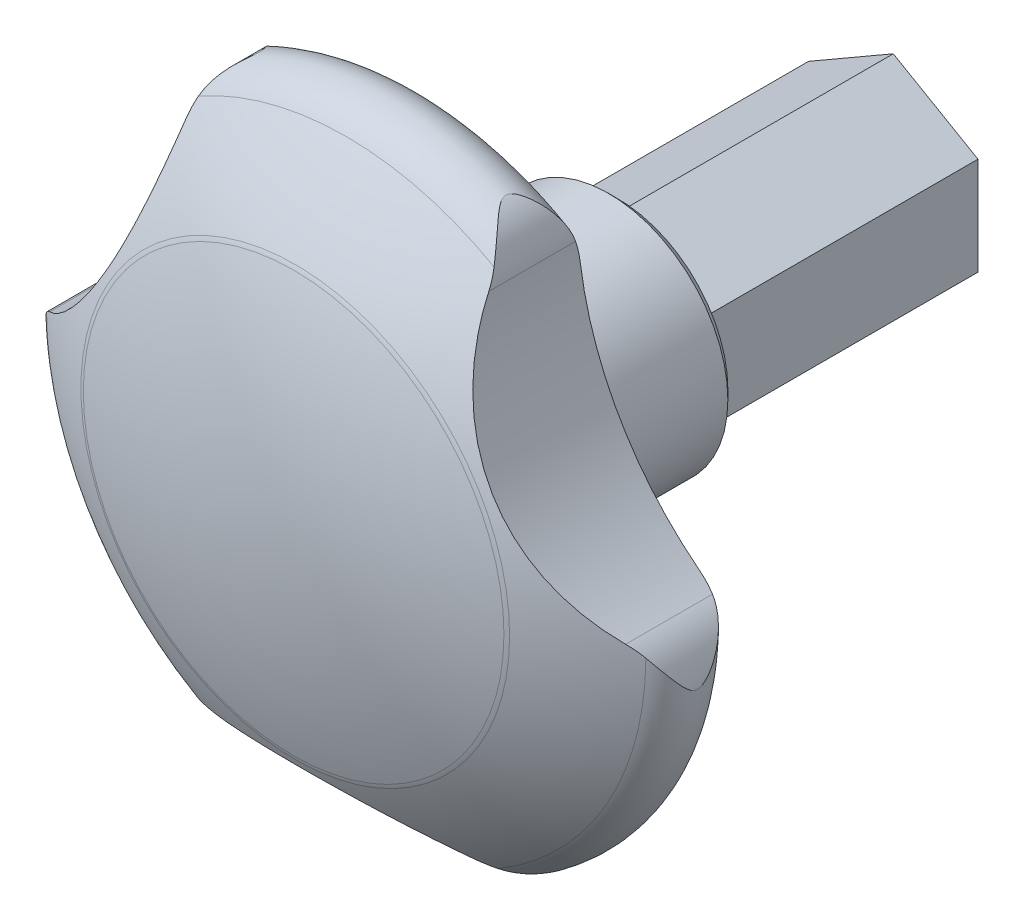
ISO-10303-21;
HEADER;
FILE_DESCRIPTION(('STEP AP214'),'2;1');
FILE_NAME('part.step','',(''),(''),'','','');
FILE_SCHEMA(('AUTOMOTIVE_DESIGN { 1 0 10303 214 1 1 1 1 }'));
ENDSEC;
DATA;
#1=APPLICATION_CONTEXT('core data for automotive mechanical design processes');
#2=APPLICATION_PROTOCOL_DEFINITION('international standard','automotive_design',2000,#1);
#3=PRODUCT_CONTEXT('',#1,'mechanical');
#4=PRODUCT('Part','Part','',(#3));
#5=PRODUCT_RELATED_PRODUCT_CATEGORY('part','',(#4));
#6=PRODUCT_DEFINITION_FORMATION('','',#4);
#7=PRODUCT_DEFINITION_CONTEXT('part definition',#1,'design');
#8=PRODUCT_DEFINITION('design','',#6,#7);
#9=PRODUCT_DEFINITION_SHAPE('','',#8);
#10=(LENGTH_UNIT() NAMED_UNIT(*) SI_UNIT(.MILLI.,.METRE.));
#11=(NAMED_UNIT(*) PLANE_ANGLE_UNIT() SI_UNIT($,.RADIAN.));
#12=(NAMED_UNIT(*) SI_UNIT($,.STERADIAN.) SOLID_ANGLE_UNIT());
#13=UNCERTAINTY_MEASURE_WITH_UNIT(LENGTH_MEASURE(1.E-05),#10,'distance_accuracy_value','');
#14=(GEOMETRIC_REPRESENTATION_CONTEXT(3) GLOBAL_UNCERTAINTY_ASSIGNED_CONTEXT((#13)) GLOBAL_UNIT_ASSIGNED_CONTEXT((#10,
#11,#12)) REPRESENTATION_CONTEXT('',''));
#15=CARTESIAN_POINT('',(0.,0.,0.));
#16=DIRECTION('',(0.,0.,1.));
#17=DIRECTION('',(1.,0.,0.));
#18=AXIS2_PLACEMENT_3D('',#15,#16,#17);
#19=CARTESIAN_POINT('',(0.,0.,48.25));
#20=DIRECTION('',(0.,0.,1.));
#21=DIRECTION('',(1.,0.,0.));
#22=AXIS2_PLACEMENT_3D('',#19,#20,#21);
#23=TOROIDAL_SURFACE('',#22,25.75,4.25);
#24=CARTESIAN_POINT('',(0.,0.,44.));
#25=DIRECTION('',(0.,0.,1.));
#26=DIRECTION('',(1.,0.,0.));
#27=AXIS2_PLACEMENT_3D('',#24,#25,#26);
#28=CIRCLE('',#27,25.75);
#29=CARTESIAN_POINT('',(11.2198622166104,-23.1770833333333,44.));
#30=VERTEX_POINT('',#29);
#31=CARTESIAN_POINT('',(25.6818740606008,1.87185596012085,44.));
#32=VERTEX_POINT('',#31);
#33=EDGE_CURVE('E371',#30,#32,#28,.T.);
#34=ORIENTED_EDGE('',*,*,#33,.T.);
#35=CARTESIAN_POINT('',(28.3586455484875,0.00320444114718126,51.6052149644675));
#36=CARTESIAN_POINT('',(28.2516925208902,0.069504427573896,51.6883867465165));
#37=CARTESIAN_POINT('',(28.1418002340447,0.138584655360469,51.76541518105));
#38=CARTESIAN_POINT('',(27.9176494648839,0.281624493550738,51.9072450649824));
#39=CARTESIAN_POINT('',(27.8033970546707,0.35557741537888,51.9720628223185));
#40=CARTESIAN_POINT('',(27.5728544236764,0.507132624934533,52.089189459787));
#41=CARTESIAN_POINT('',(27.4565942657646,0.584693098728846,52.1416123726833));
#42=CARTESIAN_POINT('',(27.2220769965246,0.743594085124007,52.2351405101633));
#43=CARTESIAN_POINT('',(27.1038191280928,0.824936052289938,52.2762413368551));
#44=CARTESIAN_POINT('',(26.8503622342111,1.00202466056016,52.3523826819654));
#45=CARTESIAN_POINT('',(26.7150218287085,1.09823829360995,52.3858669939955));
#46=CARTESIAN_POINT('',(26.4442444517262,1.29418495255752,52.4397186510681));
#47=CARTESIAN_POINT('',(26.3088074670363,1.39391981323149,52.4600790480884));
#48=CARTESIAN_POINT('',(25.9029090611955,1.69818625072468,52.5029042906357));
#49=CARTESIAN_POINT('',(25.6336969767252,1.90719632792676,52.5068760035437));
#50=CARTESIAN_POINT('',(25.1665412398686,2.28277908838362,52.4769466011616));
#51=CARTESIAN_POINT('',(24.9666600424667,2.44783929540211,52.451689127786));
#52=CARTESIAN_POINT('',(24.5733706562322,2.78118653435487,52.3796707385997));
#53=CARTESIAN_POINT('',(24.3799662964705,2.94947538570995,52.3328973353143));
#54=CARTESIAN_POINT('',(24.0008238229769,3.28788639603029,52.2205572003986));
#55=CARTESIAN_POINT('',(23.8150784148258,3.45800660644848,52.1550088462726));
#56=CARTESIAN_POINT('',(23.4515313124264,3.79932659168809,52.0073250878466));
#57=CARTESIAN_POINT('',(23.2737257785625,3.97052579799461,51.9251978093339));
#58=CARTESIAN_POINT('',(23.0436302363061,4.19748748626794,51.8065678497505));
#59=CARTESIAN_POINT('',(22.9876855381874,4.25311091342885,51.7767195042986));
#60=CARTESIAN_POINT('',(22.876658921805,4.36436741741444,51.7154968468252));
#61=CARTESIAN_POINT('',(22.8215769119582,4.42000049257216,51.6841226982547));
#62=CARTESIAN_POINT('',(22.6228730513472,4.62225830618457,51.5673480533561));
#63=CARTESIAN_POINT('',(22.4818040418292,4.76886629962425,51.477521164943));
#64=CARTESIAN_POINT('',(22.2057864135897,5.06149285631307,51.2880284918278));
#65=CARTESIAN_POINT('',(22.0708384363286,5.20751135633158,51.1883616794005));
#66=CARTESIAN_POINT('',(21.8074497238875,5.49810787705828,50.979353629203));
#67=CARTESIAN_POINT('',(21.6790015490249,5.64268738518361,50.8700238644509));
#68=CARTESIAN_POINT('',(21.4289742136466,5.92948922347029,50.641058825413));
#69=CARTESIAN_POINT('',(21.3073919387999,6.07171260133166,50.5214282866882));
#70=CARTESIAN_POINT('',(21.0905557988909,6.33002794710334,50.2899398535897));
#71=CARTESIAN_POINT('',(20.9941694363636,6.44671035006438,50.1798209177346));
#72=CARTESIAN_POINT('',(20.8545182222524,6.61826513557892,50.0064049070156));
#73=CARTESIAN_POINT('',(20.8086697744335,6.67502344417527,49.9470516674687));
#74=CARTESIAN_POINT('',(20.7190244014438,6.78680408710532,49.8252533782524));
#75=CARTESIAN_POINT('',(20.6752270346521,6.841826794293,49.7628090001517));
#76=CARTESIAN_POINT('',(20.5893723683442,6.95043375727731,49.6331660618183));
#77=CARTESIAN_POINT('',(20.5473580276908,7.0039769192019,49.5659041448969));
#78=CARTESIAN_POINT('',(20.4665524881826,7.10763492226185,49.4267569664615));
#79=CARTESIAN_POINT('',(20.4277647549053,7.15774606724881,49.3548668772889));
#80=CARTESIAN_POINT('',(20.3549250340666,7.25241006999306,49.2062302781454));
#81=CARTESIAN_POINT('',(20.3208340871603,7.29700829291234,49.1295325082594));
#82=CARTESIAN_POINT('',(20.2588472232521,7.37850158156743,48.9699023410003));
#83=CARTESIAN_POINT('',(20.2309337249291,7.41541849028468,48.8869885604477));
#84=CARTESIAN_POINT('',(20.1889604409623,7.47112318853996,48.7329814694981));
#85=CARTESIAN_POINT('',(20.1732132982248,7.4921011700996,48.6631680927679));
#86=CARTESIAN_POINT('',(20.148771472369,7.52471351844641,48.520223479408));
#87=CARTESIAN_POINT('',(20.1400631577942,7.5363659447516,48.4470989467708));
#88=CARTESIAN_POINT('',(20.1308624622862,7.5486782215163,48.2988172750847));
#89=CARTESIAN_POINT('',(20.1304302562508,7.54925756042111,48.2236492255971));
#90=CARTESIAN_POINT('',(20.1380098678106,7.53911309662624,48.0744759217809));
#91=CARTESIAN_POINT('',(20.1460326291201,7.52837464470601,48.0004723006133));
#92=CARTESIAN_POINT('',(20.1718648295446,7.49389425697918,47.8402662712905));
#93=CARTESIAN_POINT('',(20.1914073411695,7.46785323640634,47.7548612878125));
#94=CARTESIAN_POINT('',(20.2383689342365,7.40558163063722,47.5901708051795));
#95=CARTESIAN_POINT('',(20.2658081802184,7.36932496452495,47.5109016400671));
#96=CARTESIAN_POINT('',(20.3249722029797,7.29159781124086,47.361317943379));
#97=CARTESIAN_POINT('',(20.356478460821,7.2503978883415,47.2907707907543));
#98=CARTESIAN_POINT('',(20.4232268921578,7.16363713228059,47.1542288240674));
#99=CARTESIAN_POINT('',(20.4584728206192,7.11807192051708,47.0882386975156));
#100=CARTESIAN_POINT('',(20.5318957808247,7.02375954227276,46.9599363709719));
#101=CARTESIAN_POINT('',(20.5700817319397,6.97500276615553,46.8976364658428));
#102=CARTESIAN_POINT('',(20.6486871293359,6.87530966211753,46.7763532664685));
#103=CARTESIAN_POINT('',(20.6891056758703,6.82437421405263,46.7173686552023));
#104=CARTESIAN_POINT('',(20.7961257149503,6.69044218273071,46.5683122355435));
#105=CARTESIAN_POINT('',(20.864141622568,6.606212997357,46.4803667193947));
#106=CARTESIAN_POINT('',(21.0039095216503,6.43511662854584,46.3101585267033));
#107=CARTESIAN_POINT('',(21.0756632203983,6.3482482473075,46.2278984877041));
#108=CARTESIAN_POINT('',(21.2224640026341,6.17261473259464,46.0681363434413));
#109=CARTESIAN_POINT('',(21.2975158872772,6.08384693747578,45.9906415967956));
#110=CARTESIAN_POINT('',(21.4504952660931,5.90508128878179,45.8400211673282));
#111=CARTESIAN_POINT('',(21.5284231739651,5.81508325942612,45.7668961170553));
#112=CARTESIAN_POINT('',(21.7666463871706,5.5433218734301,45.5531868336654));
#113=CARTESIAN_POINT('',(21.930982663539,5.3602695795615,45.4186954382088));
#114=CARTESIAN_POINT('',(22.2693804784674,4.99283736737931,45.1652640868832));
#115=CARTESIAN_POINT('',(22.4434333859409,4.8084587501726,45.0463106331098));
#116=CARTESIAN_POINT('',(22.8105978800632,4.4295305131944,44.8185239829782));
#117=CARTESIAN_POINT('',(23.0042306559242,4.23495965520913,44.7105610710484));
#118=CARTESIAN_POINT('',(23.4019464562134,3.84641859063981,44.5141156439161));
#119=CARTESIAN_POINT('',(23.6060336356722,3.65244865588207,44.4256409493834));
#120=CARTESIAN_POINT('',(24.0236567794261,3.26681798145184,44.2711050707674));
#121=CARTESIAN_POINT('',(24.2371671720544,3.07515259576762,44.204986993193));
#122=CARTESIAN_POINT('',(24.6732364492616,2.69506258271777,44.0983250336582));
#123=CARTESIAN_POINT('',(24.8957901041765,2.50663616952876,44.057766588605));
#124=CARTESIAN_POINT('',(25.2895814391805,2.1830756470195,44.0130142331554));
#125=CARTESIAN_POINT('',(25.459131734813,2.04681269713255,44.0021108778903));
#126=CARTESIAN_POINT('',(25.8013436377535,1.77787663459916,43.9984430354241));
#127=CARTESIAN_POINT('',(25.9740054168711,1.64520372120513,44.0056795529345));
#128=CARTESIAN_POINT('',(26.3200923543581,1.38519302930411,44.0401865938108));
#129=CARTESIAN_POINT('',(26.4935096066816,1.25783226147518,44.0673586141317));
#130=CARTESIAN_POINT('',(26.8397580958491,1.00914654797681,44.1434775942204));
#131=CARTESIAN_POINT('',(27.0125896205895,0.887818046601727,44.1924115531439));
#132=CARTESIAN_POINT('',(27.3928409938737,0.626688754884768,44.3271694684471));
#133=CARTESIAN_POINT('',(27.5995408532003,0.488666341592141,44.418727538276));
#134=CARTESIAN_POINT('',(27.9019772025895,0.291783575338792,44.5841459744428));
#135=CARTESIAN_POINT('',(28.0019140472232,0.227605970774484,44.6442705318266));
#136=CARTESIAN_POINT('',(28.198154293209,0.103148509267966,44.7740483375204));
#137=CARTESIAN_POINT('',(28.2944534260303,0.0428731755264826,44.8437123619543));
#138=CARTESIAN_POINT('',(28.3884330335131,-0.0152404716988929,44.9181612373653));
#139=B_SPLINE_CURVE_WITH_KNOTS('',3,(#35,#36,#37,#38,#39,#40,#41,#42,#43,#44,#45,#46,#47,#48,
#49,#50,#51,#52,#53,#54,#55,#56,#57,#58,#59,#60,#61,#62,#63,#64,#65,#66,#67,#68,#69,#70,#71,#72,
#73,#74,#75,#76,#77,#78,#79,#80,#81,#82,#83,#84,#85,#86,#87,#88,#89,#90,#91,#92,#93,#94,#95,#96,
#97,#98,#99,#100,#101,#102,#103,#104,#105,#106,#107,#108,#109,#110,#111,#112,#113,#114,#115,
#116,#117,#118,#119,#120,#121,#122,#123,#124,#125,#126,#127,#128,#129,#130,#131,#132,#133,#134,
#135,#136,#137,#138),.UNSPECIFIED.,.F.,.F.,(4,2,2,2,2,2,2,2,2,2,2,2,2,2,2,2,2,2,2,2,2,2,2,2,2,2,
2,2,2,2,2,2,2,2,2,2,2,2,2,2,2,2,2,2,2,2,2,2,2,2,2,4),(0.,0.45221932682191,0.903830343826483,
1.35110905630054,1.79856126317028,2.30613226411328,2.81397176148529,3.8327599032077,
4.61318343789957,5.39406048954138,6.17417579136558,6.95390966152,7.20694459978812,
7.45995249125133,8.12681848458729,8.79375420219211,9.45990842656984,10.1257580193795,
10.6868350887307,10.9689321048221,11.2509681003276,11.5378614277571,11.8250590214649,
12.1097088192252,12.3935377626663,12.6164789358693,12.8389873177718,13.0631129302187,
13.287528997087,13.5601870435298,13.8335476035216,14.0958392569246,14.3583968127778,
14.6217849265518,14.8850676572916,15.3032430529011,15.721611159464,16.1406098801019,
16.5596691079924,17.4000471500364,18.2396902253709,19.1238259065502,20.0083157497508,
20.8905374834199,21.7722560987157,22.4249345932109,23.0776492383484,23.7271603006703,
24.3762838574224,25.167654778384,25.5666234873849,25.9660466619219),.UNSPECIFIED.);
#140=CARTESIAN_POINT('',(27.1837405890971,0.770283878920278,44.2530660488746));
#141=VERTEX_POINT('',#140);
#142=EDGE_CURVE('E457',#32,#141,#139,.T.);
#143=ORIENTED_EDGE('',*,*,#142,.T.);
#144=CARTESIAN_POINT('',(28.2964873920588,-0.217782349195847,51.6520042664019));
#145=CARTESIAN_POINT('',(28.4017556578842,-0.337720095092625,51.5724558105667));
#146=CARTESIAN_POINT('',(28.5009544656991,-0.460394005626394,51.4891888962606));
#147=CARTESIAN_POINT('',(28.6874204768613,-0.710052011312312,51.3160467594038));
#148=CARTESIAN_POINT('',(28.7746893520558,-0.837035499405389,51.226172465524));
#149=CARTESIAN_POINT('',(28.9392134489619,-1.09683967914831,51.0387057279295));
#150=CARTESIAN_POINT('',(29.0162246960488,-1.2297267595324,50.9409922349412));
#151=CARTESIAN_POINT('',(29.158323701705,-1.49756950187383,50.7400682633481));
#152=CARTESIAN_POINT('',(29.223416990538,-1.63252417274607,50.6368603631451));
#153=CARTESIAN_POINT('',(29.347564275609,-1.91588975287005,50.4151899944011));
#154=CARTESIAN_POINT('',(29.4054906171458,-2.06438293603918,50.2962021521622));
#155=CARTESIAN_POINT('',(29.5080814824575,-2.36068481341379,50.050979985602));
#156=CARTESIAN_POINT('',(29.5527123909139,-2.50849085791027,49.9247282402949));
#157=CARTESIAN_POINT('',(29.6096621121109,-2.72566652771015,49.7294892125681));
#158=CARTESIAN_POINT('',(29.6268949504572,-2.79683278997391,49.6638991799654));
#159=CARTESIAN_POINT('',(29.6582713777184,-2.93724129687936,49.5299898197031));
#160=CARTESIAN_POINT('',(29.6724158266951,-3.00648407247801,49.4616712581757));
#161=CARTESIAN_POINT('',(29.6976441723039,-3.14157233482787,49.321782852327));
#162=CARTESIAN_POINT('',(29.7087411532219,-3.20743132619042,49.2502284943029));
#163=CARTESIAN_POINT('',(29.7280392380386,-3.33395767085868,49.1023561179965));
#164=CARTESIAN_POINT('',(29.7362449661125,-3.39463319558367,49.0260459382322));
#165=CARTESIAN_POINT('',(29.7475571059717,-3.48754208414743,48.8939042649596));
#166=CARTESIAN_POINT('',(29.7514474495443,-3.52239924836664,48.840010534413));
#167=CARTESIAN_POINT('',(29.7580672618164,-3.58597889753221,48.7286257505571));
#168=CARTESIAN_POINT('',(29.7607983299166,-3.61470980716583,48.6711397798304));
#169=CARTESIAN_POINT('',(29.7647774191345,-3.65898907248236,48.5619698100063));
#170=CARTESIAN_POINT('',(29.766194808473,-3.67592407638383,48.5108716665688));
#171=CARTESIAN_POINT('',(29.768244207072,-3.70106711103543,48.4065499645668));
#172=CARTESIAN_POINT('',(29.7688776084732,-3.70929060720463,48.3533303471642));
#173=CARTESIAN_POINT('',(29.7693634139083,-3.71555476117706,48.2459140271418));
#174=CARTESIAN_POINT('',(29.7692108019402,-3.71353002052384,48.1917132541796));
#175=CARTESIAN_POINT('',(29.768113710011,-3.69955495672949,48.0846268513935));
#176=CARTESIAN_POINT('',(29.7671682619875,-3.68759249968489,48.0317429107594));
#177=CARTESIAN_POINT('',(29.7639777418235,-3.64977293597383,47.9091740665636));
#178=CARTESIAN_POINT('',(29.7613782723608,-3.62038762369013,47.8406252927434));
#179=CARTESIAN_POINT('',(29.7546364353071,-3.55207647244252,47.7084865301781));
#180=CARTESIAN_POINT('',(29.7504875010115,-3.51311027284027,47.6449190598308));
#181=CARTESIAN_POINT('',(29.7379432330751,-3.40704448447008,47.4890217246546));
#182=CARTESIAN_POINT('',(29.7284635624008,-3.33604366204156,47.3994899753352));
#183=CARTESIAN_POINT('',(29.7055318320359,-3.18718496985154,47.2267719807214));
#184=CARTESIAN_POINT('',(29.6920700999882,-3.10931073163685,47.1436018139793));
#185=CARTESIAN_POINT('',(29.6609396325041,-2.94934051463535,46.9813292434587));
#186=CARTESIAN_POINT('',(29.6432474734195,-2.86722309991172,46.902252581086));
#187=CARTESIAN_POINT('',(29.60359742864,-2.7009187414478,46.747628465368));
#188=CARTESIAN_POINT('',(29.5816437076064,-2.61673388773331,46.672077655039));
#189=CARTESIAN_POINT('',(29.5118027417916,-2.37157397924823,46.4575335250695));
#190=CARTESIAN_POINT('',(29.4582510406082,-2.20908748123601,46.3220650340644));
#191=CARTESIAN_POINT('',(29.3347943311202,-1.88378678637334,46.0589810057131));
#192=CARTESIAN_POINT('',(29.2648766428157,-1.72097243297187,45.9313716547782));
#193=CARTESIAN_POINT('',(29.1086142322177,-1.39849418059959,45.6846578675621));
#194=CARTESIAN_POINT('',(29.022368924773,-1.23881735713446,45.5655076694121));
#195=CARTESIAN_POINT('',(28.8326945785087,-0.923725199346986,45.3355623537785));
#196=CARTESIAN_POINT('',(28.7292703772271,-0.768308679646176,45.2247648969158));
#197=CARTESIAN_POINT('',(28.5231862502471,-0.488675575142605,45.0301537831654));
#198=CARTESIAN_POINT('',(28.4231728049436,-0.363516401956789,44.9448920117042));
#199=CARTESIAN_POINT('',(28.2107060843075,-0.118897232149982,44.782207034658));
#200=CARTESIAN_POINT('',(28.0982601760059,0.000566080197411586,44.7047792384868));
#201=CARTESIAN_POINT('',(27.8596275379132,0.23365081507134,44.558310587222));
#202=CARTESIAN_POINT('',(27.7333138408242,0.347201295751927,44.4893620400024));
#203=CARTESIAN_POINT('',(27.4679083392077,0.565733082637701,44.3624343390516));
#204=CARTESIAN_POINT('',(27.3287910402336,0.670696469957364,44.3044778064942));
#205=CARTESIAN_POINT('',(27.1835405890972,0.770421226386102,44.2529952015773));
#206=B_SPLINE_CURVE_WITH_KNOTS('',3,(#144,#145,#146,#147,#148,#149,#150,#151,#152,#153,#154,
#155,#156,#157,#158,#159,#160,#161,#162,#163,#164,#165,#166,#167,#168,#169,#170,#171,#172,#173,
#174,#175,#176,#177,#178,#179,#180,#181,#182,#183,#184,#185,#186,#187,#188,#189,#190,#191,#192,
#193,#194,#195,#196,#197,#198,#199,#200,#201,#202,#203,#204,#205),.UNSPECIFIED.,.F.,.F.,(4,2,2,
2,2,2,2,2,2,2,2,2,2,2,2,2,2,2,2,2,2,2,2,2,2,2,2,2,2,2,4),(0.,0.534644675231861,1.06921434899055,
1.61482207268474,2.16017597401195,2.75633815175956,3.35399507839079,3.64883054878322,
3.94358380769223,4.23705102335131,4.53004672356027,4.72269091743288,4.91506845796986,
5.07602562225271,5.2366965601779,5.39839409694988,5.56028935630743,5.78289311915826,
6.0064511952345,6.34956383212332,6.69351682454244,7.03942026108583,7.3849873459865,
8.03881231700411,8.69314554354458,9.34361587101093,9.99390333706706,10.5377375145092,
11.0812511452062,11.6302379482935,12.1803425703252),.UNSPECIFIED.);
#207=CARTESIAN_POINT('',(28.2967521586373,-0.21808403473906,51.6518042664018));
#208=VERTEX_POINT('',#207);
#209=EDGE_CURVE('E464',#208,#141,#206,.T.);
#210=ORIENTED_EDGE('',*,*,#209,.F.);
#211=CARTESIAN_POINT('',(0.,0.,51.6518042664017));
#212=DIRECTION('',(0.,0.,1.));
#213=DIRECTION('',(1.,0.,0.));
#214=AXIS2_PLACEMENT_3D('',#211,#212,#213);
#215=CIRCLE('',#214,28.2975925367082);
#216=CARTESIAN_POINT('',(14.3372423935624,-24.3966641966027,51.6518042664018));
#217=VERTEX_POINT('',#216);
#218=EDGE_CURVE('E367',#217,#208,#215,.T.);
#219=ORIENTED_EDGE('',*,*,#218,.F.);
#220=CARTESIAN_POINT('',(12.9245848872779,-23.9268563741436,44.2530013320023));
#221=CARTESIAN_POINT('',(13.0827658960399,-24.0023976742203,44.3042220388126));
#222=CARTESIAN_POINT('',(13.2424032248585,-24.0700892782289,44.3618521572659));
#223=CARTESIAN_POINT('',(13.5627184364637,-24.1902150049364,44.4880268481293));
#224=CARTESIAN_POINT('',(13.7233936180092,-24.24267920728,44.5565494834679));
#225=CARTESIAN_POINT('',(14.043721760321,-24.3328537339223,44.7024437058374));
#226=CARTESIAN_POINT('',(14.2033757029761,-24.3706391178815,44.7797675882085));
#227=CARTESIAN_POINT('',(14.5214120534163,-24.4326008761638,44.9422532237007));
#228=CARTESIAN_POINT('',(14.6797936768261,-24.4567694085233,45.0274194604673));
#229=CARTESIAN_POINT('',(15.0162830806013,-24.4947372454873,45.2169298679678));
#230=CARTESIAN_POINT('',(15.1940368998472,-24.5066032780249,45.3222875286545));
#231=CARTESIAN_POINT('',(15.5451457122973,-24.5148070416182,45.5406380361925));
#232=CARTESIAN_POINT('',(15.7185000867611,-24.5111426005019,45.6536319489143));
#233=CARTESIAN_POINT('',(16.0594156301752,-24.4895504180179,45.8865931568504));
#234=CARTESIAN_POINT('',(16.2269789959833,-24.4716281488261,46.0065577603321));
#235=CARTESIAN_POINT('',(16.5548027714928,-24.4229470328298,46.2534912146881));
#236=CARTESIAN_POINT('',(16.7150668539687,-24.3921947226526,46.3804564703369));
#237=CARTESIAN_POINT('',(16.9762277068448,-24.3313800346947,46.6006819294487));
#238=CARTESIAN_POINT('',(17.0796984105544,-24.3042514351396,46.691712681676));
#239=CARTESIAN_POINT('',(17.2810998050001,-24.2458665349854,46.8787922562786));
#240=CARTESIAN_POINT('',(17.3790215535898,-24.2146038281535,46.9748487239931));
#241=CARTESIAN_POINT('',(17.5676643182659,-24.1492641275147,47.1746262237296));
#242=CARTESIAN_POINT('',(17.6583241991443,-24.1151673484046,47.2784004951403));
#243=CARTESIAN_POINT('',(17.7837928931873,-24.0648870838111,47.4422579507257));
#244=CARTESIAN_POINT('',(17.8238236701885,-24.0482890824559,47.4981765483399));
#245=CARTESIAN_POINT('',(17.8988700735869,-24.0163145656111,47.6135699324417));
#246=CARTESIAN_POINT('',(17.9338937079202,-24.0009361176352,47.6730388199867));
#247=CARTESIAN_POINT('',(17.9928195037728,-23.974506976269,47.7890600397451));
#248=CARTESIAN_POINT('',(18.0175507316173,-23.963158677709,47.8451108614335));
#249=CARTESIAN_POINT('',(18.0586339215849,-23.9440703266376,47.9607213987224));
#250=CARTESIAN_POINT('',(18.0750184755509,-23.9363162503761,48.020266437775));
#251=CARTESIAN_POINT('',(18.0944718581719,-23.9270690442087,48.1296611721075));
#252=CARTESIAN_POINT('',(18.0995520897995,-23.9246321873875,48.1790605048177));
#253=CARTESIAN_POINT('',(18.1018003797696,-23.9235561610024,48.2781056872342));
#254=CARTESIAN_POINT('',(18.0989668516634,-23.9249177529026,48.3277515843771));
#255=CARTESIAN_POINT('',(18.0858826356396,-23.9311561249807,48.4255131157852));
#256=CARTESIAN_POINT('',(18.0756699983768,-23.9360148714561,48.4736352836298));
#257=CARTESIAN_POINT('',(18.0491962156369,-23.9484610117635,48.5677863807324));
#258=CARTESIAN_POINT('',(18.0329297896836,-23.9560507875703,48.6138134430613));
#259=CARTESIAN_POINT('',(17.9769122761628,-23.9817775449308,48.7494010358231));
#260=CARTESIAN_POINT('',(17.9301377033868,-24.0027725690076,48.8354413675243));
#261=CARTESIAN_POINT('',(17.826140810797,-24.0474629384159,49.0003762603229));
#262=CARTESIAN_POINT('',(17.768857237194,-24.0711737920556,49.0792246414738));
#263=CARTESIAN_POINT('',(17.6567692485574,-24.1153202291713,49.2204718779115));
#264=CARTESIAN_POINT('',(17.6028411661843,-24.1357241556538,49.2835836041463));
#265=CARTESIAN_POINT('',(17.4915508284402,-24.1759050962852,49.4069300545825));
#266=CARTESIAN_POINT('',(17.4341870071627,-24.1956818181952,49.4671634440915));
#267=CARTESIAN_POINT('',(17.25798371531,-24.2533254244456,49.6447132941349));
#268=CARTESIAN_POINT('',(17.1351944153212,-24.2894404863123,49.7586866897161));
#269=CARTESIAN_POINT('',(16.8822081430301,-24.3547311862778,49.9805991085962));
#270=CARTESIAN_POINT('',(16.75199841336,-24.3838943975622,50.0885270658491));
#271=CARTESIAN_POINT('',(16.4860377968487,-24.4339247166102,50.2991388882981));
#272=CARTESIAN_POINT('',(16.3502914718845,-24.4547985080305,50.4018269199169));
#273=CARTESIAN_POINT('',(16.0636195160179,-24.4885976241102,50.6101157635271));
#274=CARTESIAN_POINT('',(15.9123287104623,-24.5007895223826,50.7153347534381));
#275=CARTESIAN_POINT('',(15.6054467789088,-24.5135448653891,50.9200989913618));
#276=CARTESIAN_POINT('',(15.4498552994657,-24.5141073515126,51.0196437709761));
#277=CARTESIAN_POINT('',(15.1360344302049,-24.5027410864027,51.2121034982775));
#278=CARTESIAN_POINT('',(14.9778207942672,-24.49087078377,51.3050472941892));
#279=CARTESIAN_POINT('',(14.6589247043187,-24.4538822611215,51.4839809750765));
#280=CARTESIAN_POINT('',(14.4982409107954,-24.4287565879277,51.569966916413));
#281=CARTESIAN_POINT('',(14.3368487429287,-24.3965857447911,51.6520042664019));
#282=B_SPLINE_CURVE_WITH_KNOTS('',3,(#220,#221,#222,#223,#224,#225,#226,#227,#228,#229,#230,
#231,#232,#233,#234,#235,#236,#237,#238,#239,#240,#241,#242,#243,#244,#245,#246,#247,#248,#249,
#250,#251,#252,#253,#254,#255,#256,#257,#258,#259,#260,#261,#262,#263,#264,#265,#266,#267,#268,
#269,#270,#271,#272,#273,#274,#275,#276,#277,#278,#279,#280,#281),.UNSPECIFIED.,.F.,.F.,(4,2,2,
2,2,2,2,2,2,2,2,2,2,2,2,2,2,2,2,2,2,2,2,2,2,2,2,2,2,2,4),(0.,0.547312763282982,1.09353691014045,
1.6369299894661,2.18063569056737,2.80070994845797,3.42087093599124,4.04079401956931,
4.66040165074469,5.0815548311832,5.50336845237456,5.92842440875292,6.14048239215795,
6.35219734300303,6.53859721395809,6.72426354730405,6.87269653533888,7.02115928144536,
7.16886188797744,7.31669363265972,7.61542458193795,7.91595550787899,8.17224716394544,
8.42865653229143,8.94225275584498,9.45676028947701,9.97085213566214,10.5244200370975,
11.078033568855,11.6290561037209,12.180388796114),.UNSPECIFIED.);
#283=CARTESIAN_POINT('',(12.9247848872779,-23.9269518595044,44.2530660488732));
#284=VERTEX_POINT('',#283);
#285=EDGE_CURVE('E488',#284,#217,#282,.T.);
#286=ORIENTED_EDGE('',*,*,#285,.F.);
#287=CARTESIAN_POINT('',(12.9249848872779,-23.9270473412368,44.2531307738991));
#288=CARTESIAN_POINT('',(12.7672690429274,-23.8517302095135,44.2020778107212));
#289=CARTESIAN_POINT('',(12.6068056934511,-23.7768358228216,44.1593603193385));
#290=CARTESIAN_POINT('',(12.2820392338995,-23.6287926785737,44.0895705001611));
#291=CARTESIAN_POINT('',(12.11774296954,-23.5556412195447,44.0624722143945));
#292=CARTESIAN_POINT('',(11.7886938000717,-23.4127107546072,44.0230035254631));
#293=CARTESIAN_POINT('',(11.6239777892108,-23.3428993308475,44.0104369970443));
#294=CARTESIAN_POINT('',(11.2928530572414,-23.2060514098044,43.9982572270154));
#295=CARTESIAN_POINT('',(11.1264434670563,-23.139016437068,43.9986510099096));
#296=CARTESIAN_POINT('',(10.7217665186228,-22.9802040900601,44.0140274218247));
#297=CARTESIAN_POINT('',(10.4830864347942,-22.8900513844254,44.0351533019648));
#298=CARTESIAN_POINT('',(10.0060375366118,-22.7167238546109,44.0986373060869));
#299=CARTESIAN_POINT('',(9.76766885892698,-22.6335514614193,44.1410027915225));
#300=CARTESIAN_POINT('',(9.29034910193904,-22.4736374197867,44.2448702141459));
#301=CARTESIAN_POINT('',(9.05141425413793,-22.3969648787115,44.3065512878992));
#302=CARTESIAN_POINT('',(8.57636352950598,-22.2509518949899,44.4466585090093));
#303=CARTESIAN_POINT('',(8.3402470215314,-22.1816097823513,44.5250808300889));
#304=CARTESIAN_POINT('',(7.79541088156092,-22.028713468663,44.7247959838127));
#305=CARTESIAN_POINT('',(7.48799032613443,-21.9478475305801,44.8517428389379));
#306=CARTESIAN_POINT('',(7.03266325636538,-21.8355322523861,45.0599263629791));
#307=CARTESIAN_POINT('',(6.8817393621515,-21.7995665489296,45.1323448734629));
#308=CARTESIAN_POINT('',(6.58213009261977,-21.7305760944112,45.2829896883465));
#309=CARTESIAN_POINT('',(6.43344456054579,-21.6975511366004,45.3612155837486));
#310=CARTESIAN_POINT('',(6.1396692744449,-21.6345972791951,45.5229439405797));
#311=CARTESIAN_POINT('',(5.99456194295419,-21.604648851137,45.606406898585));
#312=CARTESIAN_POINT('',(5.70740797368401,-21.5475483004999,45.7793348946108));
#313=CARTESIAN_POINT('',(5.56536109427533,-21.5203959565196,45.8687994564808));
#314=CARTESIAN_POINT('',(5.28537592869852,-21.4689142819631,46.0541421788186));
#315=CARTESIAN_POINT('',(5.14743033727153,-21.4445796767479,46.1500078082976));
#316=CARTESIAN_POINT('',(4.87670431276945,-21.3987070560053,46.3493425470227));
#317=CARTESIAN_POINT('',(4.7439208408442,-21.3771673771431,46.4528070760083));
#318=CARTESIAN_POINT('',(4.55989706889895,-21.3485167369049,46.6072416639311));
#319=CARTESIAN_POINT('',(4.50555119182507,-21.3402134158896,46.6543000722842));
#320=CARTESIAN_POINT('',(4.39854911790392,-21.3241564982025,46.7504063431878));
#321=CARTESIAN_POINT('',(4.34589303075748,-21.3164029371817,46.7994543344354));
#322=CARTESIAN_POINT('',(4.24263984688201,-21.3014692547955,46.8998505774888));
#323=CARTESIAN_POINT('',(4.19204441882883,-21.2942895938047,46.9512006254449));
#324=CARTESIAN_POINT('',(4.09355777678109,-21.2805575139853,47.05650037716));
#325=CARTESIAN_POINT('',(4.04566610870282,-21.2740049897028,47.1104496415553));
#326=CARTESIAN_POINT('',(3.92703897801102,-21.2580485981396,47.2529656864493));
#327=CARTESIAN_POINT('',(3.85883192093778,-21.2491468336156,47.3437453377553));
#328=CARTESIAN_POINT('',(3.73605042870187,-21.2334795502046,47.5343265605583));
#329=CARTESIAN_POINT('',(3.68143468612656,-21.2267075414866,47.6340995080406));
#330=CARTESIAN_POINT('',(3.60973904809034,-21.217948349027,47.805298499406));
#331=CARTESIAN_POINT('',(3.58622720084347,-21.2151164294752,47.8739345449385));
#332=CARTESIAN_POINT('',(3.55062020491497,-21.2108505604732,48.0141353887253));
#333=CARTESIAN_POINT('',(3.538505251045,-21.209414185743,48.0856948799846));
#334=CARTESIAN_POINT('',(3.52735901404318,-21.2080920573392,48.2303167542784));
#335=CARTESIAN_POINT('',(3.52840650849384,-21.20821564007,48.3033855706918));
#336=CARTESIAN_POINT('',(3.54360528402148,-21.2100199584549,48.4481129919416));
#337=CARTESIAN_POINT('',(3.55776617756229,-21.2117018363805,48.519770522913));
#338=CARTESIAN_POINT('',(3.60261000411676,-21.2170883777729,48.6789952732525));
#339=CARTESIAN_POINT('',(3.6367545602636,-21.2212207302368,48.7655480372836));
#340=CARTESIAN_POINT('',(3.71789399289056,-21.2312424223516,48.9323234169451));
#341=CARTESIAN_POINT('',(3.76492990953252,-21.2371373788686,49.0125247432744));
#342=CARTESIAN_POINT('',(3.87724833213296,-21.2515426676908,49.1814030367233));
#343=CARTESIAN_POINT('',(3.9442983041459,-21.2603360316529,49.2688552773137));
#344=CARTESIAN_POINT('',(4.08628891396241,-21.2795120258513,49.4369990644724));
#345=CARTESIAN_POINT('',(4.16124357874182,-21.2898974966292,49.5176781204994));
#346=CARTESIAN_POINT('',(4.31724422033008,-21.3121627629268,49.674312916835));
#347=CARTESIAN_POINT('',(4.39834501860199,-21.3240568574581,49.750211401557));
#348=CARTESIAN_POINT('',(4.56433061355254,-21.3491326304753,49.8973493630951));
#349=CARTESIAN_POINT('',(4.64921255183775,-21.3623133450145,49.9685922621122));
#350=CARTESIAN_POINT('',(4.84405974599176,-21.3934609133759,50.1250579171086));
#351=CARTESIAN_POINT('',(4.954861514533,-21.4117868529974,50.2091636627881));
#352=CARTESIAN_POINT('',(5.17985331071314,-21.4503440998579,50.3722816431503));
#353=CARTESIAN_POINT('',(5.29404428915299,-21.4705759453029,50.4512924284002));
#354=CARTESIAN_POINT('',(5.52525580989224,-21.5129624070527,50.6049172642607));
#355=CARTESIAN_POINT('',(5.64228053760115,-21.5351200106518,50.6795241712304));
#356=CARTESIAN_POINT('',(5.87851786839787,-21.5813406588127,50.8245691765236));
#357=CARTESIAN_POINT('',(5.99773055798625,-21.6054037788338,50.8950071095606));
#358=CARTESIAN_POINT('',(6.23104037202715,-21.6540036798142,51.0279268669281));
#359=CARTESIAN_POINT('',(6.34503246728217,-21.6784317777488,51.0906331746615));
#360=CARTESIAN_POINT('',(6.57447905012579,-21.7290241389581,51.2125770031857));
#361=CARTESIAN_POINT('',(6.68993355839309,-21.7551884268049,51.2718144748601));
#362=CARTESIAN_POINT('',(6.9217228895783,-21.8091819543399,51.3865990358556));
#363=CARTESIAN_POINT('',(7.03805285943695,-21.8370046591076,51.4421589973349));
#364=CARTESIAN_POINT('',(7.27189439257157,-21.8944325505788,51.5497483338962));
#365=CARTESIAN_POINT('',(7.38940591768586,-21.9240376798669,51.6017778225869));
#366=CARTESIAN_POINT('',(7.50745214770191,-21.9545500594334,51.6520042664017));
#367=B_SPLINE_CURVE_WITH_KNOTS('',3,(#287,#288,#289,#290,#291,#292,#293,#294,#295,#296,#297,
#298,#299,#300,#301,#302,#303,#304,#305,#306,#307,#308,#309,#310,#311,#312,#313,#314,#315,#316,
#317,#318,#319,#320,#321,#322,#323,#324,#325,#326,#327,#328,#329,#330,#331,#332,#333,#334,#335,
#336,#337,#338,#339,#340,#341,#342,#343,#344,#345,#346,#347,#348,#349,#350,#351,#352,#353,#354,
#355,#356,#357,#358,#359,#360,#361,#362,#363,#364,#365,#366),.UNSPECIFIED.,.F.,.F.,(4,2,2,2,2,2,
2,2,2,2,2,2,2,2,2,2,2,2,2,2,2,2,2,2,2,2,2,2,2,2,2,2,2,2,2,2,2,2,2,4),(0.,0.545839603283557,
1.0907694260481,1.6282555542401,2.16603300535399,2.93289855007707,3.70003006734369,
4.47449804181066,5.24878919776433,6.27429618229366,6.78785178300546,7.30137124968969,
7.81139832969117,8.32138499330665,8.83040100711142,9.33911268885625,9.55617423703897,
9.77324984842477,9.99049788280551,10.2077093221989,10.5486584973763,10.8885584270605,
11.105593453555,11.3222506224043,11.5402051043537,11.7583194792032,12.0361406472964,
12.3148567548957,12.6457589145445,12.9772584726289,13.3121748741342,13.6468422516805,
14.0675828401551,14.4884425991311,14.9099672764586,15.3315086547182,15.7285667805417,
16.1256305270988,16.5212216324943,16.9168000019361),.UNSPECIFIED.);
#368=EDGE_CURVE('E480',#284,#30,#367,.T.);
#369=ORIENTED_EDGE('',*,*,#368,.T.);
#370=EDGE_LOOP('',(#34,#143,#210,#219,#286,#369));
#371=FACE_BOUND('',#370,.T.);
#372=ADVANCED_FACE('F14',(#371),#23,.T.);
#373=CARTESIAN_POINT('',(-27.1835405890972,0.770421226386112,44.2529952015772));
#374=CARTESIAN_POINT('',(-27.3280522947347,0.671203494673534,44.3042154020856));
#375=CARTESIAN_POINT('',(-27.4664941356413,0.566799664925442,44.3618450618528));
#376=CARTESIAN_POINT('',(-27.7306847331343,0.349462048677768,44.4880189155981));
#377=CARTESIAN_POINT('',(-27.8564581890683,0.236545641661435,44.5565411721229));
#378=CARTESIAN_POINT('',(-28.0947167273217,0.00422111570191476,44.7024346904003));
#379=CARTESIAN_POINT('',(-28.207267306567,-0.115150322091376,44.7797582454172));
#380=CARTESIAN_POINT('',(-28.4199469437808,-0.359596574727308,44.9422432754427));
#381=CARTESIAN_POINT('',(-28.5200688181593,-0.48467463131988,45.0274092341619));
#382=CARTESIAN_POINT('',(-28.7211954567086,-0.757098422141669,45.216918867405));
#383=CARTESIAN_POINT('',(-28.820349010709,-0.905104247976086,45.3222760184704));
#384=CARTESIAN_POINT('',(-29.0030088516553,-1.2050706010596,45.5406255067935));
#385=CARTESIAN_POINT('',(-29.0865129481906,-1.35703167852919,45.653618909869));
#386=CARTESIAN_POINT('',(-29.2382722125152,-1.66306850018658,45.886579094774));
#387=CARTESIAN_POINT('',(-29.3065332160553,-1.81714341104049,46.0065431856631));
#388=CARTESIAN_POINT('',(-29.4282869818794,-2.12538706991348,46.2534755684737));
#389=CARTESIAN_POINT('',(-29.4817872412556,-2.27955573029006,46.3804402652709));
#390=CARTESIAN_POINT('',(-29.5597017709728,-2.53613570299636,46.6006655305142));
#391=CARTESIAN_POINT('',(-29.587943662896,-2.63930915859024,46.6916967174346));
#392=CARTESIAN_POINT('',(-29.638082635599,-2.84292218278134,46.8787771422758));
#393=CARTESIAN_POINT('',(-29.659969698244,-2.94335721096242,46.9748340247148));
#394=CARTESIAN_POINT('',(-29.6977061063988,-3.1393984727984,47.1746122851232));
#395=CARTESIAN_POINT('',(-29.7135077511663,-3.23496165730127,47.2783868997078));
#396=CARTESIAN_POINT('',(-29.7326986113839,-3.36876261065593,47.4422448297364));
#397=CARTESIAN_POINT('',(-29.7383398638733,-3.41172989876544,47.4981635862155));
#398=CARTESIAN_POINT('',(-29.7481726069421,-3.49271057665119,47.6135572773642));
#399=CARTESIAN_POINT('',(-29.7523664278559,-3.53073186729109,47.6730263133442));
#400=CARTESIAN_POINT('',(-29.7589412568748,-3.59497928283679,47.7890481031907));
#401=CARTESIAN_POINT('',(-29.7614790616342,-3.62207215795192,47.845099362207));
#402=CARTESIAN_POINT('',(-29.7654898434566,-3.66719712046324,47.9607108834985));
#403=CARTESIAN_POINT('',(-29.7669669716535,-3.68526444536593,48.0202564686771));
#404=CARTESIAN_POINT('',(-29.7686854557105,-3.70673644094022,48.1296517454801));
#405=CARTESIAN_POINT('',(-29.7691152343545,-3.71235502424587,48.1790510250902));
#406=CARTESIAN_POINT('',(-29.7693075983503,-3.71484121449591,48.2780961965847));
#407=CARTESIAN_POINT('',(-29.7690700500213,-3.71170706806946,48.327742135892));
#408=CARTESIAN_POINT('',(-29.7679306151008,-3.69725764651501,48.4255038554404));
#409=CARTESIAN_POINT('',(-29.7670321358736,-3.68598433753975,48.4736261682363));
#410=CARTESIAN_POINT('',(-29.764574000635,-3.65683511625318,48.5677775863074));
#411=CARTESIAN_POINT('',(-29.763013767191,-3.63895343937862,48.6138048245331));
#412=CARTESIAN_POINT('',(-29.7572852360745,-3.57757918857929,48.7493911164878));
#413=CARTESIAN_POINT('',(-29.7520803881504,-3.52657531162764,48.8354301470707));
#414=CARTESIAN_POINT('',(-29.7387854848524,-3.41416944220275,49.0003625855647));
#415=CARTESIAN_POINT('',(-29.7306782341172,-3.35270664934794,49.0792098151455));
#416=CARTESIAN_POINT('',(-29.7128669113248,-3.23356545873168,49.2204549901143));
#417=CARTESIAN_POINT('',(-29.7035735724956,-3.17666181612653,49.2835657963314));
#418=CARTESIAN_POINT('',(-29.682726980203,-3.06019388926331,49.4069104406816));
#419=CARTESIAN_POINT('',(-29.6711726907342,-3.00062839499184,49.4671429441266));
#420=CARTESIAN_POINT('',(-29.6329934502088,-2.81921421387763,49.6446901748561));
#421=CARTESIAN_POINT('',(-29.602876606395,-2.69482075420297,49.758661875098));
#422=CARTESIAN_POINT('',(-29.5329297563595,-2.44308816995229,49.9805710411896));
#423=CARTESIAN_POINT('',(-29.4930826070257,-2.31574420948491,50.088497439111));
#424=CARTESIAN_POINT('',(-29.4034335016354,-2.06040542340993,50.2991062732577));
#425=CARTESIAN_POINT('',(-29.3536396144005,-1.93241120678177,50.4017928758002));
#426=CARTESIAN_POINT('',(-29.2395764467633,-1.66724493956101,50.610083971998));
#427=CARTESIAN_POINT('',(-29.1744888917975,-1.53012337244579,50.7153063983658));
#428=CARTESIAN_POINT('',(-29.0320924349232,-1.25797028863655,50.9200772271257));
#429=CARTESIAN_POINT('',(-28.9547825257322,-1.12293894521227,51.0196251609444));
#430=CARTESIAN_POINT('',(-28.7880254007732,-0.856837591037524,51.2120908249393));
#431=CARTESIAN_POINT('',(-28.698636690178,-0.725751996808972,51.3050374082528));
#432=CARTESIAN_POINT('',(-28.5071511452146,-0.468066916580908,51.4839763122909));
#433=CARTESIAN_POINT('',(-28.405047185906,-0.341469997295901,51.5699646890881));
#434=CARTESIAN_POINT('',(-28.296487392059,-0.217782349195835,51.6520042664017));
#435=B_SPLINE_CURVE_WITH_KNOTS('',3,(#373,#374,#375,#376,#377,#378,#379,#380,#381,#382,#383,
#384,#385,#386,#387,#388,#389,#390,#391,#392,#393,#394,#395,#396,#397,#398,#399,#400,#401,#402,
#403,#404,#405,#406,#407,#408,#409,#410,#411,#412,#413,#414,#415,#416,#417,#418,#419,#420,#421,
#422,#423,#424,#425,#426,#427,#428,#429,#430,#431,#432,#433,#434),.UNSPECIFIED.,.F.,.F.,(4,2,2,
2,2,2,2,2,2,2,2,2,2,2,2,2,2,2,2,2,2,2,2,2,2,2,2,2,2,2,4),(0.,0.547312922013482,1.09353721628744,
1.63693033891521,2.18063608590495,2.80070905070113,3.4208687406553,4.04079059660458,
4.66039700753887,5.08155336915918,5.50337010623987,5.92842905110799,6.14048857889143,
6.3522050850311,6.53860727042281,6.72427590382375,6.8727089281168,7.02117168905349,
7.16887438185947,7.31670622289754,7.61543137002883,7.91595643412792,8.17224311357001,
8.42864750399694,8.94223377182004,9.45673150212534,9.97081355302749,10.5243967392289,
11.078025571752,11.629063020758,12.1804106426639),.UNSPECIFIED.);
#436=CARTESIAN_POINT('',(-27.1837405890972,0.770283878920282,44.2530660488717));
#437=VERTEX_POINT('',#436);
#438=CARTESIAN_POINT('',(-28.2967521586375,-0.218084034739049,51.6518042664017));
#439=VERTEX_POINT('',#438);
#440=EDGE_CURVE('E355',#437,#439,#435,.T.);
#441=ORIENTED_EDGE('',*,*,#440,.F.);
#442=CARTESIAN_POINT('',(-28.3884330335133,-0.0152404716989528,44.9181612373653));
#443=CARTESIAN_POINT('',(-28.2945532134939,0.0428075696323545,44.8437793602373));
#444=CARTESIAN_POINT('',(-28.1983203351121,0.103042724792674,44.7741632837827));
#445=CARTESIAN_POINT('',(-28.0022088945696,0.227419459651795,44.6444604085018));
#446=CARTESIAN_POINT('',(-27.902334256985,0.291556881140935,44.584363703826));
#447=CARTESIAN_POINT('',(-27.7004362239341,0.422978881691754,44.4738903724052));
#448=CARTESIAN_POINT('',(-27.5984303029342,0.490241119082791,44.4234549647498));
#449=CARTESIAN_POINT('',(-27.3924641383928,0.627919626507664,44.3316005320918));
#450=CARTESIAN_POINT('',(-27.2885031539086,0.698337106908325,44.2901850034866));
#451=CARTESIAN_POINT('',(-27.0413165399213,0.868095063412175,44.2026030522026));
#452=CARTESIAN_POINT('',(-26.8975732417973,0.968633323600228,44.160194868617));
#453=CARTESIAN_POINT('',(-26.6094009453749,1.17405305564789,44.0906792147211));
#454=CARTESIAN_POINT('',(-26.4649715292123,1.27893759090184,44.063582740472));
#455=CARTESIAN_POINT('',(-26.1764225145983,1.49248501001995,44.0236007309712));
#456=CARTESIAN_POINT('',(-26.0323045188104,1.60115644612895,44.0107498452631));
#457=CARTESIAN_POINT('',(-25.7457703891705,1.82131611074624,43.9982507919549));
#458=CARTESIAN_POINT('',(-25.6033537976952,1.93280355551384,43.9985989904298));
#459=CARTESIAN_POINT('',(-25.2618496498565,2.20515804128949,44.0140484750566));
#460=CARTESIAN_POINT('',(-25.0639550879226,2.36718772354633,44.0352552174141));
#461=CARTESIAN_POINT('',(-24.6743711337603,2.69450221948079,44.0990033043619));
#462=CARTESIAN_POINT('',(-24.482684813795,2.85978858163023,44.1415550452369));
#463=CARTESIAN_POINT('',(-24.1055907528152,3.19323826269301,44.2456157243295));
#464=CARTESIAN_POINT('',(-23.9202146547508,3.36141109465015,44.3072079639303));
#465=CARTESIAN_POINT('',(-23.5571913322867,3.69896649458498,44.4470465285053));
#466=CARTESIAN_POINT('',(-23.3795420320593,3.86834872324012,44.5252883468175));
#467=CARTESIAN_POINT('',(-22.9752785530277,4.26318822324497,44.7247221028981));
#468=CARTESIAN_POINT('',(-22.7516543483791,4.48886558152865,44.8515917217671));
#469=CARTESIAN_POINT('',(-22.4268866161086,4.82685017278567,45.059641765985));
#470=CARTESIAN_POINT('',(-22.3203291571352,4.93951157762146,45.1320133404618));
#471=CARTESIAN_POINT('',(-22.1108763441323,5.16436726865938,45.2825582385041));
#472=CARTESIAN_POINT('',(-22.0079807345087,5.27656158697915,45.360731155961));
#473=CARTESIAN_POINT('',(-21.8065552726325,5.49950663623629,45.5224346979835));
#474=CARTESIAN_POINT('',(-21.7080037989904,5.61026195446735,45.6059320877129));
#475=CARTESIAN_POINT('',(-21.5148567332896,5.83051968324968,45.7789348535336));
#476=CARTESIAN_POINT('',(-21.4202608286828,5.94002219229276,45.868439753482));
#477=CARTESIAN_POINT('',(-21.2355726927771,6.15687898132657,46.0538690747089));
#478=CARTESIAN_POINT('',(-21.1454722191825,6.26423695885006,46.149780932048));
#479=CARTESIAN_POINT('',(-20.9702806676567,6.47587560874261,46.349215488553));
#480=CARTESIAN_POINT('',(-20.8851866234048,6.5801580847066,46.452733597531));
#481=CARTESIAN_POINT('',(-20.7683147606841,6.7252611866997,46.6072302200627));
#482=CARTESIAN_POINT('',(-20.7339482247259,6.76817778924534,46.6542920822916));
#483=CARTESIAN_POINT('',(-20.666536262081,6.85282237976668,46.7504055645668));
#484=CARTESIAN_POINT('',(-20.6334909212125,6.89455029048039,46.7994573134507));
#485=CARTESIAN_POINT('',(-20.5689304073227,6.97650460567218,46.8998555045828));
#486=CARTESIAN_POINT('',(-20.5374162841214,7.01672997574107,46.9512034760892));
#487=CARTESIAN_POINT('',(-20.4762831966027,7.09515258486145,47.0564988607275));
#488=CARTESIAN_POINT('',(-20.4466639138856,7.13335016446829,47.1104458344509));
#489=CARTESIAN_POINT('',(-20.3735345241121,7.22810239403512,47.2529556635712));
#490=CARTESIAN_POINT('',(-20.331723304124,7.28271860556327,47.3437311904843));
#491=CARTESIAN_POINT('',(-20.2567631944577,7.38121821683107,47.5343110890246));
#492=CARTESIAN_POINT('',(-20.2235887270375,7.42513328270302,47.6340875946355));
#493=CARTESIAN_POINT('',(-20.1801521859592,7.48284795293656,47.8052960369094));
#494=CARTESIAN_POINT('',(-20.1659425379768,7.5017954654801,47.8739378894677));
#495=CARTESIAN_POINT('',(-20.1444452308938,7.53049837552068,48.0141394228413));
#496=CARTESIAN_POINT('',(-20.1371444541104,7.54027119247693,48.0856933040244));
#497=CARTESIAN_POINT('',(-20.1304266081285,7.54926269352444,48.230297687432));
#498=CARTESIAN_POINT('',(-20.131056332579,7.54841873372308,48.3033545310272));
#499=CARTESIAN_POINT('',(-20.1402153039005,7.53616237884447,48.4480829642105));
#500=CARTESIAN_POINT('',(-20.1487529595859,7.52473873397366,48.5197529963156));
#501=CARTESIAN_POINT('',(-20.1758431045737,7.48859163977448,48.6790001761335));
#502=CARTESIAN_POINT('',(-20.1964969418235,7.46108398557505,48.7655627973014));
#503=CARTESIAN_POINT('',(-20.2457469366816,7.39582442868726,48.9323359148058));
#504=CARTESIAN_POINT('',(-20.2743665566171,7.35804227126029,49.0125267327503));
#505=CARTESIAN_POINT('',(-20.343089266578,7.26785861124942,49.1816236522));
#506=CARTESIAN_POINT('',(-20.3843412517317,7.21404328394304,49.2692833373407));
#507=CARTESIAN_POINT('',(-20.4721887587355,7.10035045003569,49.4378131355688));
#508=CARTESIAN_POINT('',(-20.5187938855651,7.04046207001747,49.518670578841));
#509=CARTESIAN_POINT('',(-20.6161141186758,6.91645614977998,49.6752477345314));
#510=CARTESIAN_POINT('',(-20.6668495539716,6.85231802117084,49.7509381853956));
#511=CARTESIAN_POINT('',(-20.7713118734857,6.72142280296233,49.8976868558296));
#512=CARTESIAN_POINT('',(-20.8250365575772,6.6546676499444,49.9687484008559));
#513=CARTESIAN_POINT('',(-20.9472483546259,6.50419057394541,50.1224643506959));
#514=CARTESIAN_POINT('',(-21.0163553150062,6.4200054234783,50.2041690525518));
#515=CARTESIAN_POINT('',(-21.1577325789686,6.24974626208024,50.3627573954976));
#516=CARTESIAN_POINT('',(-21.230003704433,6.16367176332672,50.4396397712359));
#517=CARTESIAN_POINT('',(-21.3774253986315,5.99013604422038,50.5892006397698));
#518=CARTESIAN_POINT('',(-21.4525788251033,5.90267350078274,50.6618747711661));
#519=CARTESIAN_POINT('',(-21.6054855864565,5.7268283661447,50.8032757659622));
#520=CARTESIAN_POINT('',(-21.6832391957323,5.63844567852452,50.8720022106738));
#521=CARTESIAN_POINT('',(-21.9202338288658,5.37229153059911,51.0726085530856));
#522=CARTESIAN_POINT('',(-22.083177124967,5.19355120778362,51.1988838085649));
#523=CARTESIAN_POINT('',(-22.4182176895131,4.83510641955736,51.436679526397));
#524=CARTESIAN_POINT('',(-22.5903101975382,4.65540249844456,51.5482075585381));
#525=CARTESIAN_POINT('',(-22.9713764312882,4.26752294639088,51.7721616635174));
#526=CARTESIAN_POINT('',(-23.1818878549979,4.05932424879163,51.8819583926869));
#527=CARTESIAN_POINT('',(-23.6147864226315,3.6440077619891,52.0783601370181));
#528=CARTESIAN_POINT('',(-23.8371795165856,3.43689057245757,52.1649533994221));
#529=CARTESIAN_POINT('',(-24.2923202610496,3.02603917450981,52.3109574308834));
#530=CARTESIAN_POINT('',(-24.5250271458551,2.82229537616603,52.3704662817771));
#531=CARTESIAN_POINT('',(-24.9999133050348,2.41952491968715,52.4581192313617));
#532=CARTESIAN_POINT('',(-25.2420820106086,2.22049337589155,52.4862973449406));
#533=CARTESIAN_POINT('',(-25.7481159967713,1.81785648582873,52.5064978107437));
#534=CARTESIAN_POINT('',(-26.0124245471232,1.61465677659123,52.4963254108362));
#535=CARTESIAN_POINT('',(-26.41035349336,1.31904807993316,52.4450672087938));
#536=CARTESIAN_POINT('',(-26.5430940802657,1.22214517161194,52.4220262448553));
#537=CARTESIAN_POINT('',(-26.8082317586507,1.03186888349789,52.3631476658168));
#538=CARTESIAN_POINT('',(-26.9406289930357,0.938493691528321,52.3273167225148));
#539=CARTESIAN_POINT('',(-27.1836366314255,0.769983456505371,52.2486636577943));
#540=CARTESIAN_POINT('',(-27.2944608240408,0.694254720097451,52.2077693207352));
#541=CARTESIAN_POINT('',(-27.5141674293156,0.546225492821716,52.1159064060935));
#542=CARTESIAN_POINT('',(-27.6230505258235,0.473923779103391,52.0649414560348));
#543=CARTESIAN_POINT('',(-27.8387983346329,0.332622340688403,51.9521892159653));
#544=CARTESIAN_POINT('',(-27.9456403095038,0.263653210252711,51.8903196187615));
#545=CARTESIAN_POINT('',(-28.1554037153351,0.130038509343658,51.7558458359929));
#546=CARTESIAN_POINT('',(-28.2583204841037,0.0653980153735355,51.6832293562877));
#547=CARTESIAN_POINT('',(-28.3586455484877,0.00320444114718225,51.6052149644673));
#548=B_SPLINE_CURVE_WITH_KNOTS('',3,(#442,#443,#444,#445,#446,#447,#448,#449,#450,#451,#452,
#453,#454,#455,#456,#457,#458,#459,#460,#461,#462,#463,#464,#465,#466,#467,#468,#469,#470,#471,
#472,#473,#474,#475,#476,#477,#478,#479,#480,#481,#482,#483,#484,#485,#486,#487,#488,#489,#490,
#491,#492,#493,#494,#495,#496,#497,#498,#499,#500,#501,#502,#503,#504,#505,#506,#507,#508,#509,
#510,#511,#512,#513,#514,#515,#516,#517,#518,#519,#520,#521,#522,#523,#524,#525,#526,#527,#528,
#529,#530,#531,#532,#533,#534,#535,#536,#537,#538,#539,#540,#541,#542,#543,#544,#545,#546,#547),
.UNSPECIFIED.,.F.,.F.,(4,2,2,2,2,2,2,2,2,2,2,2,2,2,2,2,2,2,2,2,2,2,2,2,2,2,2,2,2,2,2,2,2,2,2,2,
2,2,2,2,2,2,2,2,2,2,2,2,2,2,2,2,4),(0.,0.399104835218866,0.79779159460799,1.19396975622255,
1.59030121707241,2.13090002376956,2.67188656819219,3.21418608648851,3.75633630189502,
4.52508672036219,5.29421193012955,6.06675082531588,6.83908087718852,7.86402750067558,
8.37730930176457,8.89055520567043,9.40086279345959,9.9111299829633,10.4204243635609,
10.9294138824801,11.1464919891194,11.3635841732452,11.5808231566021,11.7980255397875,
12.1389605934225,12.4788741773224,12.6959274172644,12.9125677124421,13.1304868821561,
13.3486380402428,13.6264913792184,13.9051719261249,14.236896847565,14.5692265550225,
14.9033043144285,15.2371393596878,15.6454377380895,16.0538428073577,16.4626638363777,
16.8715281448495,17.6894308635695,18.5069121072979,19.4532467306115,20.400059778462,
21.3434162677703,22.2857475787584,23.2828040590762,23.7802396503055,24.2774161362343,
24.6979894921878,25.1184116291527,25.5421547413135,25.9663864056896),.UNSPECIFIED.);
#549=CARTESIAN_POINT('',(-25.6818740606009,1.87185596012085,44.));
#550=VERTEX_POINT('',#549);
#551=EDGE_CURVE('E333',#437,#550,#548,.T.);
#552=ORIENTED_EDGE('',*,*,#551,.T.);
#553=CARTESIAN_POINT('',(-11.2198622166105,-23.1770833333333,44.));
#554=VERTEX_POINT('',#553);
#555=EDGE_CURVE('E377',#550,#554,#28,.T.);
#556=ORIENTED_EDGE('',*,*,#555,.T.);
#557=CARTESIAN_POINT('',(-7.50745214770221,-21.9545500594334,51.6520042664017));
#558=CARTESIAN_POINT('',(-7.40766750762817,-21.9287583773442,51.6095527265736));
#559=CARTESIAN_POINT('',(-7.30827182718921,-21.9036160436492,51.565809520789));
#560=CARTESIAN_POINT('',(-7.11031452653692,-21.8546088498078,51.4757921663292));
#561=CARTESIAN_POINT('',(-7.01175290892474,-21.8307439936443,51.4295180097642));
#562=CARTESIAN_POINT('',(-6.71721056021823,-21.7609881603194,51.2868842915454));
#563=CARTESIAN_POINT('',(-6.52256958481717,-21.7169867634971,51.1867975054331));
#564=CARTESIAN_POINT('',(-6.13915794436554,-21.6342224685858,50.9776029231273));
#565=CARTESIAN_POINT('',(-5.95035273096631,-21.5954204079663,50.8685738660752));
#566=CARTESIAN_POINT('',(-5.57820089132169,-21.5225581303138,50.6402790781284));
#567=CARTESIAN_POINT('',(-5.39485137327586,-21.4884953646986,50.5210189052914));
#568=CARTESIAN_POINT('',(-5.06346113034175,-21.4299972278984,50.290043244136));
#569=CARTESIAN_POINT('',(-4.91436164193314,-21.4048883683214,50.1800360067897));
#570=CARTESIAN_POINT('',(-4.69602447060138,-21.369730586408,50.006691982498));
#571=CARTESIAN_POINT('',(-4.62387260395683,-21.3583914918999,49.9472852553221));
#572=CARTESIAN_POINT('',(-4.48210245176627,-21.3366237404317,49.8253746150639));
#573=CARTESIAN_POINT('',(-4.41248361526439,-21.3261948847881,49.762871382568));
#574=CARTESIAN_POINT('',(-4.27540992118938,-21.3061328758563,49.633143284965));
#575=CARTESIAN_POINT('',(-4.20801012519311,-21.2965157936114,49.5658572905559));
#576=CARTESIAN_POINT('',(-4.07779504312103,-21.2783596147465,49.426658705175));
#577=CARTESIAN_POINT('',(-4.01498467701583,-21.2698216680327,49.3547413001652));
#578=CARTESIAN_POINT('',(-3.89659292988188,-21.254074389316,49.2060973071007));
#579=CARTESIAN_POINT('',(-3.84094817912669,-21.2468531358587,49.1294232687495));
#580=CARTESIAN_POINT('',(-3.73942183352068,-21.2339231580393,48.9698445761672));
#581=CARTESIAN_POINT('',(-3.69351257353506,-21.2282101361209,48.8869585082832));
#582=CARTESIAN_POINT('',(-3.62430038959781,-21.2197145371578,48.732987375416));
#583=CARTESIAN_POINT('',(-3.59826123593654,-21.216566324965,48.6631802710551));
#584=CARTESIAN_POINT('',(-3.55779520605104,-21.211705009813,48.5202362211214));
#585=CARTESIAN_POINT('',(-3.54334788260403,-21.209989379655,48.4471053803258));
#586=CARTESIAN_POINT('',(-3.52808390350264,-21.2081773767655,48.2988151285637));
#587=CARTESIAN_POINT('',(-3.52736626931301,-21.2080927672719,48.2236448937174));
#588=CARTESIAN_POINT('',(-3.53994222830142,-21.2095847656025,48.0744716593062));
#589=CARTESIAN_POINT('',(-3.55325317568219,-21.2111634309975,48.0004702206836));
#590=CARTESIAN_POINT('',(-3.59602917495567,-21.2162944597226,47.8402679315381));
#591=CARTESIAN_POINT('',(-3.62835183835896,-21.2201981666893,47.7548645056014));
#592=CARTESIAN_POINT('',(-3.70576094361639,-21.229732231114,47.5901737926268));
#593=CARTESIAN_POINT('',(-3.75088053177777,-21.2353670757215,47.5109030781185));
#594=CARTESIAN_POINT('',(-3.84778079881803,-21.2477416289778,47.3613123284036));
#595=CARTESIAN_POINT('',(-3.89921835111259,-21.2544274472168,47.2907599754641));
#596=CARTESIAN_POINT('',(-4.00773877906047,-21.2688541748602,47.1542082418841));
#597=CARTESIAN_POINT('',(-4.06482732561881,-21.2765961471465,47.0882135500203));
#598=CARTESIAN_POINT('',(-4.18321697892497,-21.293026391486,46.9599124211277));
#599=CARTESIAN_POINT('',(-4.24453024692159,-21.3017174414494,46.8976176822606));
#600=CARTESIAN_POINT('',(-4.37016056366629,-21.3199438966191,46.7763442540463));
#601=CARTESIAN_POINT('',(-4.43447640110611,-21.3294789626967,46.7173642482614));
#602=CARTESIAN_POINT('',(-4.60390139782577,-21.355183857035,46.5683725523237));
#603=CARTESIAN_POINT('',(-4.71078154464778,-21.3719610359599,46.4804827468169));
#604=CARTESIAN_POINT('',(-4.92868988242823,-21.4074294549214,46.3103792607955));
#605=CARTESIAN_POINT('',(-5.03971995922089,-21.42612157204,46.2281682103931));
#606=CARTESIAN_POINT('',(-5.26506576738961,-21.4654070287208,46.0684989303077));
#607=CARTESIAN_POINT('',(-5.37938618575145,-21.48600318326,45.9910480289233));
#608=CARTESIAN_POINT('',(-5.6105278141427,-21.5290683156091,45.8405103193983));
#609=CARTESIAN_POINT('',(-5.72734938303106,-21.5515375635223,45.7674241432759));
#610=CARTESIAN_POINT('',(-6.08187212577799,-21.621964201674,45.5536368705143));
#611=CARTESIAN_POINT('',(-6.32271823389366,-21.6727828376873,45.4190426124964));
#612=CARTESIAN_POINT('',(-6.81043601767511,-21.7821895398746,45.1654232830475));
#613=CARTESIAN_POINT('',(-7.05730235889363,-21.8407709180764,45.0463849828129));
#614=CARTESIAN_POINT('',(-7.5700668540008,-21.9695369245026,44.8181438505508));
#615=CARTESIAN_POINT('',(-7.83625910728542,-22.0401861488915,44.7098583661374));
#616=CARTESIAN_POINT('',(-8.37335898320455,-22.1908924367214,44.5129077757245));
#617=CARTESIAN_POINT('',(-8.64426816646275,-22.2709526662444,44.4242493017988));
#618=CARTESIAN_POINT('',(-9.18704983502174,-22.4399200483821,44.270011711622));
#619=CARTESIAN_POINT('',(-9.45889136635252,-22.5287404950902,44.2042308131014));
#620=CARTESIAN_POINT('',(-10.0043363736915,-22.7157948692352,44.0980724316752));
#621=CARTESIAN_POINT('',(-10.2779392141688,-22.8140255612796,44.0576862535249));
#622=CARTESIAN_POINT('',(-10.752026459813,-22.99214453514,44.0132174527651));
#623=CARTESIAN_POINT('',(-10.9526466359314,-23.0699827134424,44.0023449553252));
#624=CARTESIAN_POINT('',(-11.3522087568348,-23.2299865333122,43.9983342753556));
#625=CARTESIAN_POINT('',(-11.5511518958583,-23.3121487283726,44.0051821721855));
#626=CARTESIAN_POINT('',(-11.9491141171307,-23.4815336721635,44.038767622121));
#627=CARTESIAN_POINT('',(-12.1480820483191,-23.5688169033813,44.0658261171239));
#628=CARTESIAN_POINT('',(-12.5410136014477,-23.7461891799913,44.1422228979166));
#629=CARTESIAN_POINT('',(-12.7349627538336,-23.8362849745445,44.1916193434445));
#630=CARTESIAN_POINT('',(-12.9249848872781,-23.9270473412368,44.253130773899));
#631=B_SPLINE_CURVE_WITH_KNOTS('',3,(#557,#558,#559,#560,#561,#562,#563,#564,#565,#566,#567,
#568,#569,#570,#571,#572,#573,#574,#575,#576,#577,#578,#579,#580,#581,#582,#583,#584,#585,#586,
#587,#588,#589,#590,#591,#592,#593,#594,#595,#596,#597,#598,#599,#600,#601,#602,#603,#604,#605,
#606,#607,#608,#609,#610,#611,#612,#613,#614,#615,#616,#617,#618,#619,#620,#621,#622,#623,#624,
#625,#626,#627,#628,#629,#630),.UNSPECIFIED.,.F.,.F.,(4,2,2,2,2,2,2,2,2,2,2,2,2,2,2,2,2,2,2,2,2,
2,2,2,2,2,2,2,2,2,2,2,2,2,2,2,4),(0.,0.334370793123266,0.668742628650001,1.33814652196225,
2.00218475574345,2.66586450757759,3.22639354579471,3.50876505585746,3.79107477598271,
4.07806802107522,4.36536454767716,4.6499144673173,4.93364461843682,5.15656643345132,
5.37909415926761,5.60322620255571,5.82763583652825,6.10028875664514,6.3736544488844,
6.63596619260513,6.89854389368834,7.16191186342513,7.42517448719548,7.84307419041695,
8.2611661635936,8.67988645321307,9.09866722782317,9.93959187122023,10.7797966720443,
11.6668080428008,12.5541186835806,13.4333919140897,14.3123639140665,14.9580804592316,
15.6032899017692,16.2589690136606,16.9163651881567),.UNSPECIFIED.);
#632=CARTESIAN_POINT('',(-12.9247848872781,-23.9269518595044,44.253066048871));
#633=VERTEX_POINT('',#632);
#634=EDGE_CURVE('E230',#554,#633,#631,.T.);
#635=ORIENTED_EDGE('',*,*,#634,.T.);
#636=CARTESIAN_POINT('',(-14.336848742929,-24.3965857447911,51.6520042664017));
#637=CARTESIAN_POINT('',(-14.4933520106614,-24.42778186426,51.5724558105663));
#638=CARTESIAN_POINT('',(-14.649190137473,-24.452353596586,51.4891888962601));
#639=CARTESIAN_POINT('',(-14.958633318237,-24.4890088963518,51.3160467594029));
#640=CARTESIAN_POINT('',(-15.1122386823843,-24.5010942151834,51.2261724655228));
#641=CARTESIAN_POINT('',(-15.4194977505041,-24.5136741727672,51.0387057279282));
#642=CARTESIAN_POINT('',(-15.5730869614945,-24.5139243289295,50.9409922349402));
#643=CARTESIAN_POINT('',(-15.8760950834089,-24.5030643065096,50.7400682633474));
#644=CARTESIAN_POINT('',(-16.0255159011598,-24.4919594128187,50.6368603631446));
#645=CARTESIAN_POINT('',(-16.33299133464,-24.4577913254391,50.4151899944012));
#646=CARTESIAN_POINT('',(-16.4905533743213,-24.4337104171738,50.2962021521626));
#647=CARTESIAN_POINT('',(-16.7984537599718,-24.3744057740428,50.0509799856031));
#648=CARTESIAN_POINT('',(-16.9487730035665,-24.3391542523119,49.9247282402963));
#649=CARTESIAN_POINT('',(-17.1653275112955,-24.2798863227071,49.7294892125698));
#650=CARTESIAN_POINT('',(-17.2355757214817,-24.2592272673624,49.663899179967));
#651=CARTESIAN_POINT('',(-17.3728612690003,-24.2161957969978,49.5299898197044));
#652=CARTESIAN_POINT('',(-17.4398994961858,-24.1938238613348,49.4616712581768));
#653=CARTESIAN_POINT('',(-17.5695035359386,-24.1481281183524,49.3217828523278));
#654=CARTESIAN_POINT('',(-17.6320875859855,-24.1248088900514,49.2502284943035));
#655=CARTESIAN_POINT('',(-17.7513116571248,-24.0782583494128,49.1023561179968));
#656=CARTESIAN_POINT('',(-17.8079610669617,-24.0550269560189,49.0260459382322));
#657=CARTESIAN_POINT('',(-17.8940785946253,-24.018369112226,48.893904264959));
#658=CARTESIAN_POINT('',(-17.9262109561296,-24.0043096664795,48.840010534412));
#659=CARTESIAN_POINT('',(-17.9845824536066,-23.9782527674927,48.7286257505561));
#660=CARTESIAN_POINT('',(-18.010829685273,-23.9662524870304,48.6711397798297));
#661=CARTESIAN_POINT('',(-18.0511661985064,-23.947558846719,48.5619698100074));
#662=CARTESIAN_POINT('',(-18.0665410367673,-23.9403188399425,48.5108716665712));
#663=CARTESIAN_POINT('',(-18.0893402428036,-23.9295221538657,48.4065499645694));
#664=CARTESIAN_POINT('',(-18.0967787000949,-23.9259589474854,48.3533303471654));
#665=CARTESIAN_POINT('',(-18.1024465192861,-23.9232475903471,48.2459140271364));
#666=CARTESIAN_POINT('',(-18.1006167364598,-23.9241277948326,48.1917132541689));
#667=CARTESIAN_POINT('',(-18.0879654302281,-23.9301652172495,48.0846268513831));
#668=CARTESIAN_POINT('',(-18.0771329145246,-23.9353276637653,48.0317429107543));
#669=CARTESIAN_POINT('',(-18.0427849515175,-23.9514743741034,47.9091740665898));
#670=CARTESIAN_POINT('',(-18.0160367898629,-23.9639158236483,47.8406252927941));
#671=CARTESIAN_POINT('',(-17.9535066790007,-23.9922327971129,47.7084865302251));
#672=CARTESIAN_POINT('',(-17.917686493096,-24.0081228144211,47.6449190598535));
#673=CARTESIAN_POINT('',(-17.8195586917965,-24.0502920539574,47.4890217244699));
#674=CARTESIAN_POINT('',(-17.7533303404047,-24.0775828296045,47.3994899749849));
#675=CARTESIAN_POINT('',(-17.6129490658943,-24.1321527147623,47.2267719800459));
#676=CARTESIAN_POINT('',(-17.5387771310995,-24.1594316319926,47.1436018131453));
#677=CARTESIAN_POINT('',(-17.3846736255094,-24.2124569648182,46.981329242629));
#678=CARTESIAN_POINT('',(-17.3047117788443,-24.238193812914,46.9022525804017));
#679=CARTESIAN_POINT('',(-17.1408629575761,-24.2870080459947,46.7476284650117));
#680=CARTESIAN_POINT('',(-17.0569798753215,-24.3100879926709,46.672077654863));
#681=CARTESIAN_POINT('',(-16.8097446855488,-24.3721838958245,46.4575335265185));
#682=CARTESIAN_POINT('',(-16.6422514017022,-24.4070500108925,46.3220650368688));
#683=CARTESIAN_POINT('',(-16.2988043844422,-24.4627837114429,46.0589810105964));
#684=CARTESIAN_POINT('',(-16.1228441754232,-24.483640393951,45.9313716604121));
#685=CARTESIAN_POINT('',(-15.7654386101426,-24.5095523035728,45.684657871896));
#686=CARTESIAN_POINT('',(-15.5840317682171,-24.5147000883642,45.5655076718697));
#687=CARTESIAN_POINT('',(-15.2163167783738,-24.507983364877,45.3355623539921));
#688=CARTESIAN_POINT('',(-15.0300100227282,-24.4961236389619,45.2247648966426));
#689=CARTESIAN_POINT('',(-14.6848001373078,-24.4574662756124,45.0301546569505));
#690=CARTESIAN_POINT('',(-14.526403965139,-24.4334319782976,44.9448936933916));
#691=CARTESIAN_POINT('',(-14.2083273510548,-24.3717408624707,44.7822101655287));
#692=CARTESIAN_POINT('',(-14.0486477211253,-24.3340920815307,44.7047830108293));
#693=CARTESIAN_POINT('',(-13.7274773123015,-24.2439739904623,44.5583154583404));
#694=CARTESIAN_POINT('',(-13.5659844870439,-24.1913592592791,44.4893673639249));
#695=CARTESIAN_POINT('',(-13.244030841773,-24.0707793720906,44.3624402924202));
#696=CARTESIAN_POINT('',(-13.0835727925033,-24.0027831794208,44.3044839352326));
#697=CARTESIAN_POINT('',(-12.9245848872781,-23.9268563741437,44.2530013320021));
#698=B_SPLINE_CURVE_WITH_KNOTS('',3,(#636,#637,#638,#639,#640,#641,#642,#643,#644,#645,#646,
#647,#648,#649,#650,#651,#652,#653,#654,#655,#656,#657,#658,#659,#660,#661,#662,#663,#664,#665,
#666,#667,#668,#669,#670,#671,#672,#673,#674,#675,#676,#677,#678,#679,#680,#681,#682,#683,#684,
#685,#686,#687,#688,#689,#690,#691,#692,#693,#694,#695,#696,#697),.UNSPECIFIED.,.F.,.F.,(4,2,2,
2,2,2,2,2,2,2,2,2,2,2,2,2,2,2,2,2,2,2,2,2,2,2,2,2,2,2,4),(0.,0.534644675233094,1.06921434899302,
1.61482207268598,2.16017597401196,2.75633815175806,3.35399507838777,3.64883054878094,
3.94358380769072,4.23705102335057,4.53004672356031,4.72269091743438,4.91506845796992,
5.07602562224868,5.23669656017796,5.39839409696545,5.5602893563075,5.78289311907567,
6.00645119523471,6.34956383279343,6.69351682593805,7.03942026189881,7.38498734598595,
8.0388123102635,8.69314553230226,9.34361587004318,9.99390333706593,10.5377321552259,
11.0812404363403,11.630221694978,12.1803207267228),.UNSPECIFIED.);
#699=CARTESIAN_POINT('',(-14.3372423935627,-24.3966641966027,51.6518042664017));
#700=VERTEX_POINT('',#699);
#701=EDGE_CURVE('E222',#700,#633,#698,.T.);
#702=ORIENTED_EDGE('',*,*,#701,.F.);
#703=EDGE_CURVE('E372',#439,#700,#215,.T.);
#704=ORIENTED_EDGE('',*,*,#703,.F.);
#705=EDGE_LOOP('',(#441,#552,#556,#635,#702,#704));
#706=FACE_BOUND('',#705,.T.);
#707=ADVANCED_FACE('F391',(#706),#23,.T.);
#708=CARTESIAN_POINT('',(0.,0.,26.));
#709=DIRECTION('',(0.,0.,1.));
#710=DIRECTION('',(1.,0.,0.));
#711=AXIS2_PLACEMENT_3D('',#708,#709,#710);
#712=CONICAL_SURFACE('',#711,10.3833333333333,0.785398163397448);
#713=CARTESIAN_POINT('',(0.,0.,26.8666666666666));
#714=DIRECTION('',(0.,0.,1.));
#715=DIRECTION('',(1.,0.,0.));
#716=AXIS2_PLACEMENT_3D('',#713,#714,#715);
#717=CIRCLE('',#716,11.25);
#718=CARTESIAN_POINT('',(11.25,0.,26.8666666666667));
#719=VERTEX_POINT('',#718);
#720=EDGE_CURVE('E261',#719,#719,#717,.T.);
#721=ORIENTED_EDGE('',*,*,#720,.F.);
#722=EDGE_LOOP('',(#721));
#723=FACE_BOUND('',#722,.T.);
#724=CARTESIAN_POINT('',(0.,0.,26.));
#725=DIRECTION('',(0.,0.,1.));
#726=DIRECTION('',(1.,0.,0.));
#727=AXIS2_PLACEMENT_3D('',#724,#725,#726);
#728=CIRCLE('',#727,10.3833333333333);
#729=CARTESIAN_POINT('',(10.3833333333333,0.,26.));
#730=VERTEX_POINT('',#729);
#731=EDGE_CURVE('E197',#730,#730,#728,.T.);
#732=ORIENTED_EDGE('',*,*,#731,.T.);
#733=EDGE_LOOP('',(#732));
#734=FACE_BOUND('',#733,.T.);
#735=ADVANCED_FACE('F388',(#723,#734),#712,.T.);
#736=CARTESIAN_POINT('',(-1.18710365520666E-13,0.,60.));
#737=DIRECTION('',(0.,0.,1.));
#738=DIRECTION('',(1.,0.,0.));
#739=AXIS2_PLACEMENT_3D('',#736,#737,#738);
#740=CYLINDRICAL_SURFACE('',#739,11.25);
#741=CARTESIAN_POINT('',(0.,0.,41.75));
#742=DIRECTION('',(0.,0.,1.));
#743=DIRECTION('',(1.,0.,0.));
#744=AXIS2_PLACEMENT_3D('',#741,#742,#743);
#745=CIRCLE('',#744,11.25);
#746=CARTESIAN_POINT('',(11.2499999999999,0.,41.75));
#747=VERTEX_POINT('',#746);
#748=EDGE_CURVE('E379',#747,#747,#745,.T.);
#749=ORIENTED_EDGE('',*,*,#748,.F.);
#750=EDGE_LOOP('',(#749));
#751=FACE_BOUND('',#750,.T.);
#752=ORIENTED_EDGE('',*,*,#720,.T.);
#753=EDGE_LOOP('',(#752));
#754=FACE_BOUND('',#753,.T.);
#755=ADVANCED_FACE('F386',(#751,#754),#740,.T.);
#756=CARTESIAN_POINT('',(0.,0.,41.75));
#757=DIRECTION('',(0.,0.,1.));
#758=DIRECTION('',(1.,0.,0.));
#759=AXIS2_PLACEMENT_3D('',#756,#757,#758);
#760=TOROIDAL_SURFACE('',#759,13.5,2.25);
#761=CARTESIAN_POINT('',(0.,0.,44.));
#762=DIRECTION('',(0.,0.,1.));
#763=DIRECTION('',(1.,0.,0.));
#764=AXIS2_PLACEMENT_3D('',#761,#762,#763);
#765=CIRCLE('',#764,13.5);
#766=CARTESIAN_POINT('',(13.4999999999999,0.,44.));
#767=VERTEX_POINT('',#766);
#768=EDGE_CURVE('E376',#767,#767,#765,.T.);
#769=ORIENTED_EDGE('',*,*,#768,.F.);
#770=EDGE_LOOP('',(#769));
#771=FACE_BOUND('',#770,.T.);
#772=ORIENTED_EDGE('',*,*,#748,.T.);
#773=EDGE_LOOP('',(#772));
#774=FACE_BOUND('',#773,.T.);
#775=ADVANCED_FACE('F423',(#771,#774),#760,.F.);
#776=CARTESIAN_POINT('',(0.,13.5,44.));
#777=DIRECTION('',(0.,0.,1.));
#778=DIRECTION('',(1.,0.,0.));
#779=AXIS2_PLACEMENT_3D('',#776,#777,#778);
#780=PLANE('',#779);
#781=CARTESIAN_POINT('',(14.4620118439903,21.3052273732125,44.));
#782=VERTEX_POINT('',#781);
#783=CARTESIAN_POINT('',(-14.4620118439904,21.3052273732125,44.));
#784=VERTEX_POINT('',#783);
#785=EDGE_CURVE('E373',#782,#784,#28,.T.);
#786=ORIENTED_EDGE('',*,*,#785,.F.);
#787=CARTESIAN_POINT('',(44.1672955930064,25.5,44.));
#788=DIRECTION('',(0.,0.,1.));
#789=DIRECTION('',(1.,0.,0.));
#790=AXIS2_PLACEMENT_3D('',#787,#788,#789);
#791=CIRCLE('',#790,30.);
#792=EDGE_CURVE('E433',#32,#782,#791,.F.);
#793=ORIENTED_EDGE('',*,*,#792,.F.);
#794=ORIENTED_EDGE('',*,*,#33,.F.);
#795=CARTESIAN_POINT('',(-1.01010580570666E-13,-51.,44.));
#796=DIRECTION('',(0.,0.,1.));
#797=DIRECTION('',(1.,0.,0.));
#798=AXIS2_PLACEMENT_3D('',#795,#796,#797);
#799=CIRCLE('',#798,30.);
#800=EDGE_CURVE('E486',#554,#30,#799,.F.);
#801=ORIENTED_EDGE('',*,*,#800,.F.);
#802=ORIENTED_EDGE('',*,*,#555,.F.);
#803=CARTESIAN_POINT('',(-44.1672955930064,25.5,44.));
#804=DIRECTION('',(0.,0.,1.));
#805=DIRECTION('',(1.,0.,0.));
#806=AXIS2_PLACEMENT_3D('',#803,#804,#805);
#807=CIRCLE('',#806,30.);
#808=EDGE_CURVE('E341',#784,#550,#807,.F.);
#809=ORIENTED_EDGE('',*,*,#808,.F.);
#810=EDGE_LOOP('',(#786,#793,#794,#801,#802,#809));
#811=FACE_BOUND('',#810,.T.);
#812=ORIENTED_EDGE('',*,*,#768,.T.);
#813=EDGE_LOOP('',(#812));
#814=FACE_BOUND('',#813,.T.);
#815=ADVANCED_FACE('F417',(#811,#814),#780,.F.);
#816=CARTESIAN_POINT('',(14.2589713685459,23.1564679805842,44.2530074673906));
#817=CARTESIAN_POINT('',(14.2453009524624,23.3312271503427,44.3042286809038));
#818=CARTESIAN_POINT('',(14.2241043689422,23.5033226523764,44.3618592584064));
#819=CARTESIAN_POINT('',(14.1679776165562,23.8407860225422,44.4880347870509));
#820=CARTESIAN_POINT('',(14.1330748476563,24.0061665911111,44.5565578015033));
#821=CARTESIAN_POINT('',(14.0510032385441,24.3286655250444,44.7024527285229));
#822=CARTESIAN_POINT('',(14.0038989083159,24.4858222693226,44.7797769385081));
#823=CARTESIAN_POINT('',(13.8985403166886,24.7922300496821,44.9422631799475));
#824=CARTESIAN_POINT('',(13.8402796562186,24.9414764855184,45.0274296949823));
#825=CARTESIAN_POINT('',(13.704915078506,25.2518683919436,45.216940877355));
#826=CARTESIAN_POINT('',(13.6263138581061,25.4117406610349,45.3222990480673));
#827=CARTESIAN_POINT('',(13.457862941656,25.7199114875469,45.5406505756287));
#828=CARTESIAN_POINT('',(13.3680116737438,25.8682084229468,45.6536449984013));
#829=CARTESIAN_POINT('',(13.1788534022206,26.152653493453,45.8866072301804));
#830=CARTESIAN_POINT('',(13.0795500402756,26.2888062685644,46.0065723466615));
#831=CARTESIAN_POINT('',(12.8734780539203,26.5483689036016,46.2535068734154));
#832=CARTESIAN_POINT('',(12.7667132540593,26.6717852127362,46.380472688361));
#833=CARTESIAN_POINT('',(12.5834657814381,26.867548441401,46.600698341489));
#834=CARTESIAN_POINT('',(12.5082368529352,26.94359143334,46.6917286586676));
#835=CARTESIAN_POINT('',(12.3569744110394,27.0888158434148,46.8788073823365));
#836=CARTESIAN_POINT('',(12.2809398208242,27.1579863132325,46.9748634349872));
#837=CARTESIAN_POINT('',(12.130033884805,27.2886841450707,47.1746401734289));
#838=CARTESIAN_POINT('',(12.055175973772,27.35014866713,47.2784141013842));
#839=CARTESIAN_POINT('',(11.9488989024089,27.4336663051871,47.4422710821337));
#840=CARTESIAN_POINT('',(11.9145096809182,27.4600345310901,47.4981895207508));
#841=CARTESIAN_POINT('',(11.8492967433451,27.5090384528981,47.613582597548));
#842=CARTESIAN_POINT('',(11.818467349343,27.5316801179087,47.673051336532));
#843=CARTESIAN_POINT('',(11.7661174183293,27.5694957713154,47.7890719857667));
#844=CARTESIAN_POINT('',(11.7439245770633,27.5852389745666,47.8451223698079));
#845=CARTESIAN_POINT('',(11.7068533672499,27.6112728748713,47.9607319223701));
#846=CARTESIAN_POINT('',(11.6919465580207,27.6215847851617,48.0202764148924));
#847=CARTESIAN_POINT('',(11.6742125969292,27.6338075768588,48.1296706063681));
#848=CARTESIAN_POINT('',(11.6695625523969,27.636988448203,48.1790699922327));
#849=CARTESIAN_POINT('',(11.6675074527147,27.6383968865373,48.2781151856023));
#850=CARTESIAN_POINT('',(11.6701038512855,27.6366234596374,48.3277610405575));
#851=CARTESIAN_POINT('',(11.682049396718,27.6284107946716,48.4255223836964));
#852=CARTESIAN_POINT('',(11.691363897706,27.6219954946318,48.4736444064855));
#853=CARTESIAN_POINT('',(11.715380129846,27.605291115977,48.5677951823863));
#854=CARTESIAN_POINT('',(11.7300865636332,27.5949986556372,48.6138220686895));
#855=CARTESIAN_POINT('',(11.7803767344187,27.5593484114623,48.7494109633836));
#856=CARTESIAN_POINT('',(11.82194752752,27.5293369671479,48.8354525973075));
#857=CARTESIAN_POINT('',(11.912651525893,27.461616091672,49.0003899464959));
#858=CARTESIAN_POINT('',(11.9618287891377,27.4238613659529,49.0792394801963));
#859=CARTESIAN_POINT('',(12.0561070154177,27.3488613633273,49.220488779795));
#860=CARTESIAN_POINT('',(12.1007424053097,27.3123591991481,49.2836014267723));
#861=CARTESIAN_POINT('',(12.1911872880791,27.2360672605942,49.4069496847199));
#862=CARTESIAN_POINT('',(12.2369973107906,27.1962759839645,49.4671839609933));
#863=CARTESIAN_POINT('',(12.3750225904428,27.072497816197,49.6447364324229));
#864=CARTESIAN_POINT('',(12.4676955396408,26.9842142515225,49.7587115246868));
#865=CARTESIAN_POINT('',(12.6507352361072,26.7977619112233,49.9806271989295));
#866=CARTESIAN_POINT('',(12.7410976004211,26.6995758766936,50.0885567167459));
#867=CARTESIAN_POINT('',(12.9174079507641,26.4942566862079,50.299171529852));
#868=CARTESIAN_POINT('',(13.0033594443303,26.3871308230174,50.4018609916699));
#869=CARTESIAN_POINT('',(13.1759640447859,26.1557642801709,50.6101475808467));
#870=CARTESIAN_POINT('',(13.2621648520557,26.0308410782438,50.7153631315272));
#871=CARTESIAN_POINT('',(13.4266464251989,25.7714568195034,50.9201207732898));
#872=CARTESIAN_POINT('',(13.5049265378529,25.636994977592,51.0196623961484));
#873=CARTESIAN_POINT('',(13.6519884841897,25.3595416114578,51.2121161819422));
#874=CARTESIAN_POINT('',(13.7208130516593,25.2165929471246,51.3050571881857));
#875=CARTESIAN_POINT('',(13.8482240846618,24.9219340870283,51.4839856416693));
#876=CARTESIAN_POINT('',(13.9068047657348,24.7702190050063,51.5699691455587));
#877=CARTESIAN_POINT('',(13.9596386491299,24.614368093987,51.6520042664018));
#878=B_SPLINE_CURVE_WITH_KNOTS('',3,(#816,#817,#818,#819,#820,#821,#822,#823,#824,#825,#826,
#827,#828,#829,#830,#831,#832,#833,#834,#835,#836,#837,#838,#839,#840,#841,#842,#843,#844,#845,
#846,#847,#848,#849,#850,#851,#852,#853,#854,#855,#856,#857,#858,#859,#860,#861,#862,#863,#864,
#865,#866,#867,#868,#869,#870,#871,#872,#873,#874,#875,#876,#877),.UNSPECIFIED.,.F.,.F.,(4,2,2,
2,2,2,2,2,2,2,2,2,2,2,2,2,2,2,2,2,2,2,2,2,2,2,2,2,2,2,4),(0.,0.547312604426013,1.09353660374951,
1.63692963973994,2.18063529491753,2.80071084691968,3.42087313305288,4.04079744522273,
4.66040629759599,5.08155629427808,5.50336679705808,5.92841976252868,6.14047620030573,
6.35218959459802,6.53858714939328,6.72425118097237,6.87268413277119,7.02114686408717,
7.16884938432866,7.31668103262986,7.61541778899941,7.91595458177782,8.17225121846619,
8.42866556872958,8.9422717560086,9.45678910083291,9.9708907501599,10.5244433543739,
11.078041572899,11.6290491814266,12.1803669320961),.UNSPECIFIED.);
#879=CARTESIAN_POINT('',(14.2589557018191,23.1566679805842,44.2530660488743));
#880=VERTEX_POINT('',#879);
#881=CARTESIAN_POINT('',(13.9595097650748,24.6147482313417,51.6518042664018));
#882=VERTEX_POINT('',#881);
#883=EDGE_CURVE('E428',#880,#882,#878,.T.);
#884=ORIENTED_EDGE('',*,*,#883,.F.);
#885=CARTESIAN_POINT('',(14.258940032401,23.1568679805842,44.2531246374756));
#886=CARTESIAN_POINT('',(14.2725715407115,22.9826233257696,44.202072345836));
#887=CARTESIAN_POINT('',(14.2879429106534,22.8062106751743,44.1593555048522));
#888=CARTESIAN_POINT('',(14.3221172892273,22.4509329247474,44.08956693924));
#889=CARTESIAN_POINT('',(14.3409145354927,22.2720724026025,44.0624692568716));
#890=CARTESIAN_POINT('',(14.3816579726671,21.9156421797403,44.0230017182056));
#891=CARTESIAN_POINT('',(14.4035576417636,21.7380882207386,44.0104357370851));
#892=CARTESIAN_POINT('',(14.4506064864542,21.3829018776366,43.9982570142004));
#893=CARTESIAN_POINT('',(14.4757574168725,21.2052695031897,43.9986512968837));
#894=CARTESIAN_POINT('',(14.5405607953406,20.7754020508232,44.0140288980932));
#895=CARTESIAN_POINT('',(14.581826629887,20.5236218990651,44.0351555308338));
#896=CARTESIAN_POINT('',(14.6702457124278,20.0238201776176,44.0986410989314));
#897=CARTESIAN_POINT('',(14.7174009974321,19.7757999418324,44.1410073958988));
#898=CARTESIAN_POINT('',(14.8175719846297,19.2824705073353,44.244876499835));
#899=CARTESIAN_POINT('',(14.8706394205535,19.0372099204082,44.3065584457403));
#900=CARTESIAN_POINT('',(14.9817146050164,18.5527961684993,44.446667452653));
#901=CARTESIAN_POINT('',(15.0397212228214,18.313641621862,44.525090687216));
#902=CARTESIAN_POINT('',(15.1797276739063,17.7653520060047,44.7248073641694));
#903=CARTESIAN_POINT('',(15.2634060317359,17.4586860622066,44.8517546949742));
#904=CARTESIAN_POINT('',(15.3938016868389,17.0082051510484,45.0599388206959));
#905=CARTESIAN_POINT('',(15.4381164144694,16.8595188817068,45.1323575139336));
#906=CARTESIAN_POINT('',(15.5281735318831,16.5655554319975,45.2830026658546));
#907=CARTESIAN_POINT('',(15.5739158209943,16.4202780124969,45.3612287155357));
#908=CARTESIAN_POINT('',(15.6662837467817,16.1343852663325,45.5229573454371));
#909=CARTESIAN_POINT('',(15.7129012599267,15.9937449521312,45.6064204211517));
#910=CARTESIAN_POINT('',(15.8070275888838,15.7165131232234,45.7793486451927));
#911=CARTESIAN_POINT('',(15.8545363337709,15.5799212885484,45.8688133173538));
#912=CARTESIAN_POINT('',(15.9499442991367,15.3117072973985,46.0541562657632));
#913=CARTESIAN_POINT('',(15.9978426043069,15.1800761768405,46.1500220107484));
#914=CARTESIAN_POINT('',(16.0934785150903,14.9226854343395,46.3493570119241));
#915=CARTESIAN_POINT('',(16.1412161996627,14.796922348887,46.4528216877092));
#916=CARTESIAN_POINT('',(16.2084153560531,14.6232294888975,46.607255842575));
#917=CARTESIAN_POINT('',(16.2283970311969,14.5720139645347,46.6543136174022));
#918=CARTESIAN_POINT('',(16.26799161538,14.4713210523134,46.7504185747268));
#919=CARTESIAN_POINT('',(16.2876045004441,14.421843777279,46.799465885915));
#920=CARTESIAN_POINT('',(16.3262973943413,14.3249590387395,46.8998607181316));
#921=CARTESIAN_POINT('',(16.3453769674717,14.2775532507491,46.9512100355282));
#922=CARTESIAN_POINT('',(16.3827272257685,14.185397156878,47.056508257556));
#923=CARTESIAN_POINT('',(16.4009980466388,14.1406464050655,47.1104567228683));
#924=CARTESIAN_POINT('',(16.4464925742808,14.0299351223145,47.252972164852));
#925=CARTESIAN_POINT('',(16.4728868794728,13.9664153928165,47.3437520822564));
#926=CARTESIAN_POINT('',(16.520709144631,13.8522504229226,47.5343338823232));
#927=CARTESIAN_POINT('',(16.5421521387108,13.8015661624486,47.6341071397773));
#928=CARTESIAN_POINT('',(16.570413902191,13.7350972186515,47.8053063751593));
#929=CARTESIAN_POINT('',(16.5797171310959,13.7133198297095,47.8739423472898));
#930=CARTESIAN_POINT('',(16.5938259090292,13.6803512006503,48.0141429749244));
#931=CARTESIAN_POINT('',(16.5986392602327,13.6691415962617,48.0857023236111));
#932=CARTESIAN_POINT('',(16.6030670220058,13.6588284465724,48.2303238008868));
#933=CARTESIAN_POINT('',(16.602650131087,13.6597977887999,48.3033923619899));
#934=CARTESIAN_POINT('',(16.5966130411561,13.6738631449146,48.4481192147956));
#935=CARTESIAN_POINT('',(16.5909890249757,13.6869680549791,48.5197764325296));
#936=CARTESIAN_POINT('',(16.5732316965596,13.7284979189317,48.6790012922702));
#937=CARTESIAN_POINT('',(16.5597379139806,13.7601346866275,48.7655544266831));
#938=CARTESIAN_POINT('',(16.5278467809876,13.8354154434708,48.9323304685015));
#939=CARTESIAN_POINT('',(16.5094337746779,13.8790977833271,49.0125320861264));
#940=CARTESIAN_POINT('',(16.4657492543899,13.983572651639,49.1814115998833));
#941=CARTESIAN_POINT('',(16.4398390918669,14.0460374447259,49.268864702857));
#942=CARTESIAN_POINT('',(16.3854497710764,14.1785952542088,49.4370101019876));
#943=CARTESIAN_POINT('',(16.3569660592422,14.2487018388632,49.5176899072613));
#944=CARTESIAN_POINT('',(16.2982471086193,14.3949374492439,49.67432612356));
#945=CARTESIAN_POINT('',(16.2679968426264,14.4711211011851,49.750225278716));
#946=CARTESIAN_POINT('',(16.206719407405,14.6274092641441,49.8973645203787));
#947=CARTESIAN_POINT('',(16.1756928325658,14.7075108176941,49.9686080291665));
#948=CARTESIAN_POINT('',(16.1052436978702,14.8918279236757,50.1250731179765));
#949=CARTESIAN_POINT('',(16.0657138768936,14.9969473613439,50.2091778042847));
#950=CARTESIAN_POINT('',(15.9866102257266,15.2110731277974,50.3722937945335));
#951=CARTESIAN_POINT('',(15.9470363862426,15.3200805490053,50.4513036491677));
#952=CARTESIAN_POINT('',(15.8681391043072,15.5415071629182,50.6049267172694));
#953=CARTESIAN_POINT('',(15.8288161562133,15.6539314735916,50.6795327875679));
#954=CARTESIAN_POINT('',(15.7507264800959,15.8816275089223,50.8245762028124));
#955=CARTESIAN_POINT('',(15.7119597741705,15.9968993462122,50.8950133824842));
#956=CARTESIAN_POINT('',(15.6373942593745,16.2232498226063,51.0279318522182));
#957=CARTESIAN_POINT('',(15.6015538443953,16.3341831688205,51.090637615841));
#958=CARTESIAN_POINT('',(15.530645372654,16.5581843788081,51.2125804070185));
#959=CARTESIAN_POINT('',(15.4955773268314,16.6712522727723,51.2718173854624));
#960=CARTESIAN_POINT('',(15.426442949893,16.8989829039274,51.3866010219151));
#961=CARTESIAN_POINT('',(15.3923733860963,17.013638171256,51.4421605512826));
#962=CARTESIAN_POINT('',(15.3251871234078,17.2448632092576,51.5497490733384));
#963=CARTESIAN_POINT('',(15.2920703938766,17.3614329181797,51.601778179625));
#964=CARTESIAN_POINT('',(15.2594720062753,17.4789193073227,51.6520042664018));
#965=B_SPLINE_CURVE_WITH_KNOTS('',3,(#885,#886,#887,#888,#889,#890,#891,#892,#893,#894,#895,
#896,#897,#898,#899,#900,#901,#902,#903,#904,#905,#906,#907,#908,#909,#910,#911,#912,#913,#914,
#915,#916,#917,#918,#919,#920,#921,#922,#923,#924,#925,#926,#927,#928,#929,#930,#931,#932,#933,
#934,#935,#936,#937,#938,#939,#940,#941,#942,#943,#944,#945,#946,#947,#948,#949,#950,#951,#952,
#953,#954,#955,#956,#957,#958,#959,#960,#961,#962,#963,#964),.UNSPECIFIED.,.F.,.F.,(4,2,2,2,2,2,
2,2,2,2,2,2,2,2,2,2,2,2,2,2,2,2,2,2,2,2,2,2,2,2,2,2,2,2,2,2,2,2,2,4),(0.,0.54583953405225,
1.09076929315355,1.6282553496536,2.16603272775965,2.93290092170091,3.70003509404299,
4.47450582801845,5.24879973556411,6.27430450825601,6.78785901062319,7.3013773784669,
7.81140326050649,8.3213887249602,8.83040352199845,9.33911397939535,9.55617175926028,
9.77324360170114,9.99048788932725,10.2076955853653,10.5486450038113,10.8885451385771,
11.105579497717,11.3222360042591,11.5401897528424,11.7583034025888,12.0361262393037,
12.3148440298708,12.6457504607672,12.9772543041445,13.3121750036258,13.6468466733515,
14.0675835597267,14.4884396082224,14.9099605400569,15.3314981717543,15.7285534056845,
16.1256142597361,16.521202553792,16.9167781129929),.UNSPECIFIED.);
#966=EDGE_CURVE('E429',#880,#782,#965,.T.);
#967=ORIENTED_EDGE('',*,*,#966,.T.);
#968=ORIENTED_EDGE('',*,*,#785,.T.);
#969=CARTESIAN_POINT('',(-15.2594720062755,17.4789193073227,51.6520042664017));
#970=CARTESIAN_POINT('',(-15.287028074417,17.3796074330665,51.6095527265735));
#971=CARTESIAN_POINT('',(-15.3149520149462,17.2809570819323,51.5658095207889));
#972=CARTESIAN_POINT('',(-15.3714891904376,17.0850174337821,51.475792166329));
#973=CARTESIAN_POINT('',(-15.4001024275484,16.98772814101,51.429518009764));
#974=CARTESIAN_POINT('',(-15.4869632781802,16.6977690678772,51.2868842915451));
#975=CARTESIAN_POINT('',(-15.5461774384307,16.5072043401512,51.1867975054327));
#976=CARTESIAN_POINT('',(-15.666207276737,16.1337779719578,50.9776029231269));
#977=CARTESIAN_POINT('',(-15.7270063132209,15.9508668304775,50.8685738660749));
#978=CARTESIAN_POINT('',(-15.8499816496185,15.5921427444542,50.6402790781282));
#979=CARTESIAN_POINT('',(-15.9121571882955,15.4163260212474,50.5210189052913));
#980=CARTESIAN_POINT('',(-16.0271914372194,15.1000845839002,50.2900432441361));
#981=CARTESIAN_POINT('',(-16.0799962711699,14.9584062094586,50.1800360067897));
#982=CARTESIAN_POINT('',(-16.1587173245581,14.7517417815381,50.006691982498));
#983=CARTESIAN_POINT('',(-16.1849733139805,14.6835868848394,49.9472852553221));
#984=CARTESIAN_POINT('',(-16.237006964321,14.5499264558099,49.8253746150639));
#985=CARTESIAN_POINT('',(-16.2627847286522,14.4844203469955,49.7628713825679));
#986=CARTESIAN_POINT('',(-16.3139473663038,14.3556800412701,49.6331432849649));
#987=CARTESIAN_POINT('',(-16.3393186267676,14.292501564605,49.5658572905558));
#988=CARTESIAN_POINT('',(-16.388702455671,14.1706539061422,49.426658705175));
#989=CARTESIAN_POINT('',(-16.4127135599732,14.1119895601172,49.3547413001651));
#990=CARTESIAN_POINT('',(-16.4582718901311,14.0015856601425,49.2060973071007));
#991=CARTESIAN_POINT('',(-16.4798404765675,13.9497852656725,49.1294232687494));
#992=CARTESIAN_POINT('',(-16.5194059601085,13.8553958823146,48.9698445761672));
#993=CARTESIAN_POINT('',(-16.5374129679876,13.812780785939,48.8869585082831));
#994=CARTESIAN_POINT('',(-16.5646616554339,13.7485934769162,48.7329873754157));
#995=CARTESIAN_POINT('',(-16.5749548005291,13.724468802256,48.6631802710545));
#996=CARTESIAN_POINT('',(-16.5909777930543,13.686993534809,48.5202362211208));
#997=CARTESIAN_POINT('',(-16.5967156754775,13.6736239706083,48.4471053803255));
#998=CARTESIAN_POINT('',(-16.6027784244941,13.659498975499,48.298815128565));
#999=CARTESIAN_POINT('',(-16.6030639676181,13.6588351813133,48.2236448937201));
#1000=CARTESIAN_POINT('',(-16.5980680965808,13.670472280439,48.0744716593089));
#1001=CARTESIAN_POINT('',(-16.5927797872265,13.6827892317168,48.0004702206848));
#1002=CARTESIAN_POINT('',(-16.5758353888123,13.7223998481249,47.8402679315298));
#1003=CARTESIAN_POINT('',(-16.5630547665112,13.752343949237,47.7548645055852));
#1004=CARTESIAN_POINT('',(-16.5326069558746,13.8241492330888,47.5901737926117));
#1005=CARTESIAN_POINT('',(-16.5149270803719,13.8660413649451,47.5109030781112));
#1006=CARTESIAN_POINT('',(-16.4771936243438,13.956146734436,47.3613123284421));
#1007=CARTESIAN_POINT('',(-16.4572649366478,14.0040358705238,47.2907599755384));
#1008=CARTESIAN_POINT('',(-16.4154986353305,14.105230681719,47.1542082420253));
#1009=CARTESIAN_POINT('',(-16.3936591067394,14.1585417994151,47.0882135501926));
#1010=CARTESIAN_POINT('',(-16.3486932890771,14.2692853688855,46.9599124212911));
#1011=CARTESIAN_POINT('',(-16.3255633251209,14.3267297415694,46.897617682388));
#1012=CARTESIAN_POINT('',(-16.2785327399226,14.4446420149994,46.7763442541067));
#1013=CARTESIAN_POINT('',(-16.2546324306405,14.5051086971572,46.717364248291));
#1014=CARTESIAN_POINT('',(-16.1921810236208,14.6646874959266,46.5683725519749));
#1015=CARTESIAN_POINT('',(-16.153270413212,14.7656370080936,46.4804827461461));
#1016=CARTESIAN_POINT('',(-16.0750327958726,14.9720853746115,46.3103792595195));
#1017=CARTESIAN_POINT('',(-16.0357056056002,15.0775863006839,46.2281682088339));
#1018=CARTESIAN_POINT('',(-15.9570549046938,15.2923842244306,46.068498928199));
#1019=CARTESIAN_POINT('',(-15.9177314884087,15.4016866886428,45.9910480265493));
#1020=CARTESIAN_POINT('',(-15.8394561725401,15.6233937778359,45.8405103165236));
#1021=CARTESIAN_POINT('',(-15.8005043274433,15.7357988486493,45.7674241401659));
#1022=CARTESIAN_POINT('',(-15.6842342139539,16.0780378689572,45.5536368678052));
#1023=CARTESIAN_POINT('',(-15.607821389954,16.3120260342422,45.4190426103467));
#1024=CARTESIAN_POINT('',(-15.458711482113,16.7891053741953,45.1654232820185));
#1025=CARTESIAN_POINT('',(-15.3860112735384,17.0321885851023,45.0463849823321));
#1026=CARTESIAN_POINT('',(-15.2411436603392,17.5406386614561,44.8181438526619));
#1027=CARTESIAN_POINT('',(-15.1692315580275,17.8064925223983,44.7098583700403));
#1028=CARTESIAN_POINT('',(-15.0311970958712,18.3469877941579,44.5129077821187));
#1029=CARTESIAN_POINT('',(-14.9650766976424,18.6216321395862,44.4242493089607));
#1030=CARTESIAN_POINT('',(-14.8400159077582,19.176178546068,44.2700117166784));
#1031=CARTESIAN_POINT('',(-14.7810159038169,19.4560104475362,44.2042308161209));
#1032=CARTESIAN_POINT('',(-14.6702872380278,20.0219068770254,44.0980724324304));
#1033=CARTESIAN_POINT('',(-14.6185560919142,20.3079692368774,44.0576862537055));
#1034=CARTESIAN_POINT('',(-14.5357683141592,20.8075985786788,44.0132176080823));
#1035=CARTESIAN_POINT('',(-14.5028683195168,21.0202580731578,44.0023451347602));
#1036=CARTESIAN_POINT('',(-14.4416550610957,21.4462874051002,43.9983341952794));
#1037=CARTESIAN_POINT('',(-14.4133382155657,21.6596565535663,44.005181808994));
#1038=CARTESIAN_POINT('',(-14.361049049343,22.0889908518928,44.0387663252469));
#1039=CARTESIAN_POINT('',(-14.3371546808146,22.3049419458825,44.0658241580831));
#1040=CARTESIAN_POINT('',(-14.2942979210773,22.733913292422,44.1422191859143));
#1041=CARTESIAN_POINT('',(-14.2753486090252,22.9469243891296,44.1916145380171));
#1042=CARTESIAN_POINT('',(-14.2589400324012,23.1568679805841,44.2531246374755));
#1043=B_SPLINE_CURVE_WITH_KNOTS('',3,(#969,#970,#971,#972,#973,#974,#975,#976,#977,#978,#979,
#980,#981,#982,#983,#984,#985,#986,#987,#988,#989,#990,#991,#992,#993,#994,#995,#996,#997,#998,
#999,#1000,#1001,#1002,#1003,#1004,#1005,#1006,#1007,#1008,#1009,#1010,#1011,#1012,#1013,#1014,
#1015,#1016,#1017,#1018,#1019,#1020,#1021,#1022,#1023,#1024,#1025,#1026,#1027,#1028,#1029,#1030,
#1031,#1032,#1033,#1034,#1035,#1036,#1037,#1038,#1039,#1040,#1041,#1042),.UNSPECIFIED.,.F.,.F.,
(4,2,2,2,2,2,2,2,2,2,2,2,2,2,2,2,2,2,2,2,2,2,2,2,2,2,2,2,2,2,2,2,2,2,2,2,4),(0.,
0.334370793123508,0.668742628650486,1.33814652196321,2.00218475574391,2.66586450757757,
3.22639354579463,3.50876505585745,3.79107477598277,4.07806802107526,4.36536454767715,
4.64991446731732,4.9336446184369,5.15656643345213,5.37909415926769,5.60322620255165,
5.82763583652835,6.10028875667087,6.37365444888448,6.63596619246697,6.89854389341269,
7.16191186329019,7.42517448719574,7.84307419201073,8.26116616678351,8.67988645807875,
9.09866723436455,9.93959187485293,10.7797966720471,11.6668080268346,12.5541186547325,
13.4333919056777,14.3123639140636,14.9580751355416,15.6032792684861,16.2589527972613,
16.9163433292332),.UNSPECIFIED.);
#1044=CARTESIAN_POINT('',(-14.2589557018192,23.1566679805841,44.2530660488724));
#1045=VERTEX_POINT('',#1044);
#1046=EDGE_CURVE('E348',#784,#1045,#1043,.T.);
#1047=ORIENTED_EDGE('',*,*,#1046,.T.);
#1048=CARTESIAN_POINT('',(-13.9596386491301,24.614368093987,51.6520042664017));
#1049=CARTESIAN_POINT('',(-13.9084036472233,24.7655019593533,51.5724558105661));
#1050=CARTESIAN_POINT('',(-13.8517643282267,24.9127476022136,51.4891888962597));
#1051=CARTESIAN_POINT('',(-13.728787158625,25.1990609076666,51.316046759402));
#1052=CARTESIAN_POINT('',(-13.6624506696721,25.3381297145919,51.2261724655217));
#1053=CARTESIAN_POINT('',(-13.5197156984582,25.6105138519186,51.0387057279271));
#1054=CARTESIAN_POINT('',(-13.4431377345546,25.7436510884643,50.9409922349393));
#1055=CARTESIAN_POINT('',(-13.2822286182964,26.0006338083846,50.7400682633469));
#1056=CARTESIAN_POINT('',(-13.1979010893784,26.1244835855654,50.6368603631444));
#1057=CARTESIAN_POINT('',(-13.0145729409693,26.3736810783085,50.4151899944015));
#1058=CARTESIAN_POINT('',(-12.914937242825,26.4980933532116,50.2962021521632));
#1059=CARTESIAN_POINT('',(-12.7096277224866,26.735090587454,50.0509799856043));
#1060=CARTESIAN_POINT('',(-12.6039393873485,26.847645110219,49.9247282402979));
#1061=CARTESIAN_POINT('',(-12.4443346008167,27.0055528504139,49.7294892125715));
#1062=CARTESIAN_POINT('',(-12.3913192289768,27.0560600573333,49.6638991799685));
#1063=CARTESIAN_POINT('',(-12.2854101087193,27.1534370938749,49.5299898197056));
#1064=CARTESIAN_POINT('',(-12.2325163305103,27.2003079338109,49.4616712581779));
#1065=CARTESIAN_POINT('',(-12.1281406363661,27.289700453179,49.3217828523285));
#1066=CARTESIAN_POINT('',(-12.0766535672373,27.3322402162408,49.250228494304));
#1067=CARTESIAN_POINT('',(-11.9767275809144,27.4122160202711,49.102356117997));
#1068=CARTESIAN_POINT('',(-11.9282838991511,27.4496601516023,49.0260459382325));
#1069=CARTESIAN_POINT('',(-11.8534785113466,27.5059111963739,48.8939042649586));
#1070=CARTESIAN_POINT('',(-11.8252364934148,27.5267089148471,48.8400105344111));
#1071=CARTESIAN_POINT('',(-11.7734848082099,27.5642316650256,48.7286257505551));
#1072=CARTESIAN_POINT('',(-11.7499686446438,27.5809622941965,48.6711397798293));
#1073=CARTESIAN_POINT('',(-11.7136112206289,27.6065479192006,48.5619698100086));
#1074=CARTESIAN_POINT('',(-11.6996537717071,27.616242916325,48.5108716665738));
#1075=CARTESIAN_POINT('',(-11.6789039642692,27.6305892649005,48.406549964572));
#1076=CARTESIAN_POINT('',(-11.6720989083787,27.6352495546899,48.3533303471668));
#1077=CARTESIAN_POINT('',(-11.6669168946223,27.6388023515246,48.2459140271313));
#1078=CARTESIAN_POINT('',(-11.6685940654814,27.6376578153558,48.1917132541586));
#1079=CARTESIAN_POINT('',(-11.6801482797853,27.6297201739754,48.084626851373));
#1080=CARTESIAN_POINT('',(-11.6900353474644,27.6229201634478,48.0317429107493));
#1081=CARTESIAN_POINT('',(-11.7211927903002,27.6012473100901,47.9091740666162));
#1082=CARTESIAN_POINT('',(-11.7453414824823,27.5843034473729,47.8406252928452));
#1083=CARTESIAN_POINT('',(-11.8011297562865,27.5443092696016,47.7084865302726));
#1084=CARTESIAN_POINT('',(-11.8328010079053,27.5212330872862,47.6449190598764));
#1085=CARTESIAN_POINT('',(-11.9183845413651,27.4573365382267,47.4890217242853));
#1086=CARTESIAN_POINT('',(-11.9751332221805,27.4136264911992,47.3994899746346));
#1087=CARTESIAN_POINT('',(-12.0925827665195,27.3193376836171,47.2267719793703));
#1088=CARTESIAN_POINT('',(-12.1532929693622,27.2687423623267,47.143601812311));
#1089=CARTESIAN_POINT('',(-12.2762660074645,27.1617974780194,46.9813292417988));
#1090=CARTESIAN_POINT('',(-12.3385356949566,27.1054169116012,46.9022525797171));
#1091=CARTESIAN_POINT('',(-12.4627344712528,26.9879267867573,46.7476284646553));
#1092=CARTESIAN_POINT('',(-12.5246638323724,26.9268218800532,46.672077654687));
#1093=CARTESIAN_POINT('',(-12.7020580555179,26.7437578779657,46.4575335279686));
#1094=CARTESIAN_POINT('',(-12.815999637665,26.6161374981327,46.3220650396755));
#1095=CARTESIAN_POINT('',(-13.0359899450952,26.3465705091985,46.0589810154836));
#1096=CARTESIAN_POINT('',(-13.1420324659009,26.2046128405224,45.9313716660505));
#1097=CARTESIAN_POINT('',(-13.343175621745,25.9080464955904,45.6846578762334));
#1098=CARTESIAN_POINT('',(-13.4383371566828,25.7535174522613,45.5655076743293));
#1099=CARTESIAN_POINT('',(-13.6163778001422,25.4317085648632,45.3355623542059));
#1100=CARTESIAN_POINT('',(-13.6992603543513,25.2644323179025,45.2247648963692));
#1101=CARTESIAN_POINT('',(-13.8383864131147,24.9461445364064,45.0301555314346));
#1102=CARTESIAN_POINT('',(-13.8967696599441,24.7969537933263,44.944895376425));
#1103=CARTESIAN_POINT('',(-14.0023810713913,24.490648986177,44.7822132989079));
#1104=CARTESIAN_POINT('',(-14.0496157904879,24.3335396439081,44.7047867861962));
#1105=CARTESIAN_POINT('',(-14.1321561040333,24.0103423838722,44.5583203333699));
#1106=CARTESIAN_POINT('',(-14.1673367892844,23.8441799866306,44.4893726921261));
#1107=CARTESIAN_POINT('',(-14.2238886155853,23.505073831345,44.3624462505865));
#1108=CARTESIAN_POINT('',(-14.2452314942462,23.3321169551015,44.3044900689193));
#1109=CARTESIAN_POINT('',(-14.2589713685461,23.1564679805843,44.2530074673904));
#1110=B_SPLINE_CURVE_WITH_KNOTS('',3,(#1048,#1049,#1050,#1051,#1052,#1053,#1054,#1055,#1056,
#1057,#1058,#1059,#1060,#1061,#1062,#1063,#1064,#1065,#1066,#1067,#1068,#1069,#1070,#1071,#1072,
#1073,#1074,#1075,#1076,#1077,#1078,#1079,#1080,#1081,#1082,#1083,#1084,#1085,#1086,#1087,#1088,
#1089,#1090,#1091,#1092,#1093,#1094,#1095,#1096,#1097,#1098,#1099,#1100,#1101,#1102,#1103,#1104,
#1105,#1106,#1107,#1108,#1109),.UNSPECIFIED.,.F.,.F.,(4,2,2,2,2,2,2,2,2,2,2,2,2,2,2,2,2,2,2,2,2,
2,2,2,2,2,2,2,2,2,4),(0.,0.534644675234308,1.06921434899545,1.61482207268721,2.16017597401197,
2.75633815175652,3.35399507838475,3.64883054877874,3.9435838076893,4.23705102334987,
4.53004672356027,4.72269091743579,4.91506845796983,5.07602562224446,5.23669656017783,
5.39839409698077,5.5602893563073,5.78289311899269,6.00645119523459,6.34956383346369,
6.69351682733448,7.0394202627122,7.3849873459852,8.03881230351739,8.69314552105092,
9.34361586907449,9.9939033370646,10.5377267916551,11.0812297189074,11.6302054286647,
12.180298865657),.UNSPECIFIED.);
#1111=CARTESIAN_POINT('',(-13.959509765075,24.6147482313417,51.6518042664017));
#1112=VERTEX_POINT('',#1111);
#1113=EDGE_CURVE('E342',#1112,#1045,#1110,.T.);
#1114=ORIENTED_EDGE('',*,*,#1113,.F.);
#1115=EDGE_CURVE('E368',#882,#1112,#215,.T.);
#1116=ORIENTED_EDGE('',*,*,#1115,.F.);
#1117=EDGE_LOOP('',(#884,#967,#968,#1047,#1114,#1116));
#1118=FACE_BOUND('',#1117,.T.);
#1119=ADVANCED_FACE('F237',(#1118),#23,.T.);
#1120=CARTESIAN_POINT('',(0.,0.,15.6327002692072));
#1121=DIRECTION('',(0.,0.,1.));
#1122=DIRECTION('',(1.,0.,0.));
#1123=AXIS2_PLACEMENT_3D('',#1120,#1121,#1122);
#1124=DEGENERATE_TOROIDAL_SURFACE('',#1123,1.32308332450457,45.,.T.);
#1125=CARTESIAN_POINT('',(13.9593808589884,24.6151283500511,51.6516042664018));
#1126=CARTESIAN_POINT('',(14.0000363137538,24.4952557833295,51.71467559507));
#1127=CARTESIAN_POINT('',(14.036713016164,24.374645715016,51.7788800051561));
#1128=CARTESIAN_POINT('',(14.102094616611,24.132741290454,51.9090514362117));
#1129=CARTESIAN_POINT('',(14.1308244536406,24.0114503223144,51.9750122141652));
#1130=CARTESIAN_POINT('',(14.180554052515,23.7682129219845,52.1085946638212));
#1131=CARTESIAN_POINT('',(14.2015540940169,23.6462665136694,52.1762162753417));
#1132=CARTESIAN_POINT('',(14.2359742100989,23.4016910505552,52.3130753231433));
#1133=CARTESIAN_POINT('',(14.2493699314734,23.2790610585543,52.3823172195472));
#1134=CARTESIAN_POINT('',(14.2589713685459,23.1564679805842,52.452128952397));
#1135=B_SPLINE_CURVE_WITH_KNOTS('',3,(#1125,#1126,#1127,#1128,#1129,#1130,#1131,#1132,#1133,
#1134),.UNSPECIFIED.,.F.,.F.,(4,2,2,2,4),(0.,0.424185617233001,0.847024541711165,
1.26984816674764,1.69401837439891),.UNSPECIFIED.);
#1136=CARTESIAN_POINT('',(14.2589557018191,23.1566679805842,52.4520150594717));
#1137=VERTEX_POINT('',#1136);
#1138=EDGE_CURVE('E302',#882,#1137,#1135,.T.);
#1139=ORIENTED_EDGE('',*,*,#1138,.F.);
#1140=ORIENTED_EDGE('',*,*,#1115,.T.);
#1141=CARTESIAN_POINT('',(-14.258971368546,23.1564679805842,52.4521289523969));
#1142=CARTESIAN_POINT('',(-14.2493699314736,23.2790610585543,52.3823172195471));
#1143=CARTESIAN_POINT('',(-14.2359742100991,23.4016910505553,52.3130753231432));
#1144=CARTESIAN_POINT('',(-14.2015540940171,23.6462665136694,52.1762162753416));
#1145=CARTESIAN_POINT('',(-14.1805540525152,23.7682129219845,52.1085946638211));
#1146=CARTESIAN_POINT('',(-14.1308244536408,24.0114503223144,51.9750122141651));
#1147=CARTESIAN_POINT('',(-14.1020946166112,24.132741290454,51.9090514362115));
#1148=CARTESIAN_POINT('',(-14.0367130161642,24.374645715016,51.778880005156));
#1149=CARTESIAN_POINT('',(-14.000036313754,24.4952557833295,51.7146755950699));
#1150=CARTESIAN_POINT('',(-13.9593808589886,24.6151283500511,51.6516042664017));
#1151=B_SPLINE_CURVE_WITH_KNOTS('',3,(#1141,#1142,#1143,#1144,#1145,#1146,#1147,#1148,#1149,
#1150),.UNSPECIFIED.,.F.,.F.,(4,2,2,2,4),(0.,0.424170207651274,0.846993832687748,
1.26983275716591,1.69401837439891),.UNSPECIFIED.);
#1152=CARTESIAN_POINT('',(-14.2589557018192,23.1566679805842,52.4520150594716));
#1153=VERTEX_POINT('',#1152);
#1154=EDGE_CURVE('E309',#1153,#1112,#1151,.T.);
#1155=ORIENTED_EDGE('',*,*,#1154,.F.);
#1156=CARTESIAN_POINT('',(-14.2589400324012,23.1568679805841,52.4519011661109));
#1157=CARTESIAN_POINT('',(-14.2804552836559,22.882239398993,52.6082946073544));
#1158=CARTESIAN_POINT('',(-14.3059407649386,22.6055290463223,52.7604339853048));
#1159=CARTESIAN_POINT('',(-14.3652118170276,22.0482835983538,53.0559066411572));
#1160=CARTESIAN_POINT('',(-14.3989983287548,21.7677480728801,53.1992389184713));
#1161=CARTESIAN_POINT('',(-14.5133872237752,20.9206592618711,53.6156968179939));
#1162=CARTESIAN_POINT('',(-14.6069933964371,20.3489623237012,53.8750904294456));
#1163=CARTESIAN_POINT('',(-14.8316142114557,19.1940256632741,54.3553607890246));
#1164=CARTESIAN_POINT('',(-14.9627775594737,18.6107488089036,54.5760786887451));
#1165=CARTESIAN_POINT('',(-15.2640127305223,17.4398874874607,54.9751610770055));
#1166=CARTESIAN_POINT('',(-15.4340723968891,16.8523044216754,55.1535387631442));
#1167=CARTESIAN_POINT('',(-15.810674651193,15.6882857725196,55.4631269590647));
#1168=CARTESIAN_POINT('',(-16.0165358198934,15.1118330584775,55.5950994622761));
#1169=CARTESIAN_POINT('',(-16.4665644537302,13.9653258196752,55.8144880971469));
#1170=CARTESIAN_POINT('',(-16.7107353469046,13.3952718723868,55.9019002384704));
#1171=CARTESIAN_POINT('',(-17.2354272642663,12.2690055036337,56.0308434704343));
#1172=CARTESIAN_POINT('',(-17.5158319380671,11.7127552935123,56.0725175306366));
#1173=CARTESIAN_POINT('',(-18.1114837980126,10.617694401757,56.1099405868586));
#1174=CARTESIAN_POINT('',(-18.4267263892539,10.078881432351,56.1056956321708));
#1175=CARTESIAN_POINT('',(-19.0513425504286,9.08373298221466,56.0544554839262));
#1176=CARTESIAN_POINT('',(-19.3573027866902,8.6249886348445,56.0123793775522));
#1177=CARTESIAN_POINT('',(-19.9916351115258,7.72813889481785,55.8926506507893));
#1178=CARTESIAN_POINT('',(-20.3200057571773,7.29003217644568,55.8150003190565));
#1179=CARTESIAN_POINT('',(-20.9969078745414,6.43614324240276,55.6246877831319));
#1180=CARTESIAN_POINT('',(-21.3454801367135,6.02040971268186,55.51195257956));
#1181=CARTESIAN_POINT('',(-22.0589100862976,5.21431597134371,55.2526203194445));
#1182=CARTESIAN_POINT('',(-22.4237670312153,4.8239546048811,55.1060248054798));
#1183=CARTESIAN_POINT('',(-23.1459512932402,4.09081651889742,54.7893192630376));
#1184=CARTESIAN_POINT('',(-23.5025877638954,3.74660330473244,54.6209475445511));
#1185=CARTESIAN_POINT('',(-24.2246001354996,3.08283185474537,54.2565215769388));
#1186=CARTESIAN_POINT('',(-24.5899769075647,2.76327608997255,54.0604645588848));
#1187=CARTESIAN_POINT('',(-25.3251686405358,2.15043309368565,53.6429893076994));
#1188=CARTESIAN_POINT('',(-25.6949598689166,1.85704547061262,53.4216761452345));
#1189=CARTESIAN_POINT('',(-26.4376898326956,1.29507649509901,52.95468224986));
#1190=CARTESIAN_POINT('',(-26.8106271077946,1.02648425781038,52.7090123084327));
#1191=CARTESIAN_POINT('',(-27.1839405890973,0.770146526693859,52.4518773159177));
#1192=B_SPLINE_CURVE_WITH_KNOTS('',3,(#1156,#1157,#1158,#1159,#1160,#1161,#1162,#1163,#1164,
#1165,#1166,#1167,#1168,#1169,#1170,#1171,#1172,#1173,#1174,#1175,#1176,#1177,#1178,#1179,#1180,
#1181,#1182,#1183,#1184,#1185,#1186,#1187,#1188,#1189,#1190,#1191),.UNSPECIFIED.,.F.,.F.,(4,2,2,
2,2,2,2,2,2,2,2,2,2,2,2,2,2,4),(0.,0.950187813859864,1.90048338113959,3.80224283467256,
5.71163886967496,7.62043895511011,9.49624529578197,11.3722195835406,13.2423130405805,
15.1121601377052,16.7692555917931,18.426244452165,20.0867042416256,21.7470884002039,
23.3160860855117,24.8852408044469,26.4480904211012,28.0102506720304),.UNSPECIFIED.);
#1193=CARTESIAN_POINT('',(-27.1837405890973,0.770283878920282,52.4520150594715));
#1194=VERTEX_POINT('',#1193);
#1195=EDGE_CURVE('E28',#1153,#1194,#1192,.T.);
#1196=ORIENTED_EDGE('',*,*,#1195,.T.);
#1197=CARTESIAN_POINT('',(-28.2970168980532,-0.218385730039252,51.6516042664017));
#1198=CARTESIAN_POINT('',(-28.213529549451,-0.123238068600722,51.7146773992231));
#1199=CARTESIAN_POINT('',(-28.1274139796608,-0.0311675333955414,51.778883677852));
#1200=CARTESIAN_POINT('',(-27.9506040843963,0.146411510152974,51.9090589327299));
#1201=CARTESIAN_POINT('',(-27.859925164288,0.231939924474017,51.9750216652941));
#1202=CARTESIAN_POINT('',(-27.674134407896,0.396629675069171,52.1086081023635));
#1203=CARTESIAN_POINT('',(-27.5790227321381,0.475791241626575,52.1762317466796));
#1204=CARTESIAN_POINT('',(-27.3844179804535,0.627890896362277,52.3130949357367));
#1205=CARTESIAN_POINT('',(-27.2849119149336,0.700808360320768,52.382338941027));
#1206=CARTESIAN_POINT('',(-27.1835405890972,0.770421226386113,52.452152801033));
#1207=B_SPLINE_CURVE_WITH_KNOTS('',3,(#1197,#1198,#1199,#1200,#1201,#1202,#1203,#1204,#1205,
#1206),.UNSPECIFIED.,.F.,.F.,(4,2,2,2,4),(0.,0.424197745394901,0.847048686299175,1.269884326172,
1.69406666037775),.UNSPECIFIED.);
#1208=EDGE_CURVE('E9',#439,#1194,#1207,.T.);
#1209=ORIENTED_EDGE('',*,*,#1208,.F.);
#1210=ORIENTED_EDGE('',*,*,#703,.T.);
#1211=CARTESIAN_POINT('',(-12.9245848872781,-23.9268563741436,52.4521408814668));
#1212=CARTESIAN_POINT('',(-13.0355556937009,-23.9798389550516,52.3823280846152));
#1213=CARTESIAN_POINT('',(-13.148455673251,-24.0295539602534,52.313085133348));
#1214=CARTESIAN_POINT('',(-13.3774772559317,-24.1220348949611,52.1762240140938));
#1215=CARTESIAN_POINT('',(-13.4935874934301,-24.1648223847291,52.1086013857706));
#1216=CARTESIAN_POINT('',(-13.7291052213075,-24.2433755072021,51.9750169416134));
#1217=CARTESIAN_POINT('',(-13.8485128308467,-24.2791408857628,51.9090551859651));
#1218=CARTESIAN_POINT('',(-14.0907023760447,-24.343472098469,51.7788818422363));
#1219=CARTESIAN_POINT('',(-14.2134938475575,-24.3720146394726,51.7146764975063));
#1220=CARTESIAN_POINT('',(-14.3376360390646,-24.3967426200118,51.6516042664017));
#1221=B_SPLINE_CURVE_WITH_KNOTS('',3,(#1211,#1212,#1213,#1214,#1215,#1216,#1217,#1218,#1219,
#1220),.UNSPECIFIED.,.F.,.F.,(4,2,2,2,4),(0.,0.424176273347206,0.847005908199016,
1.26985084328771,1.69404252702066),.UNSPECIFIED.);
#1222=CARTESIAN_POINT('',(-12.9247848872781,-23.9269518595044,52.4520150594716));
#1223=VERTEX_POINT('',#1222);
#1224=EDGE_CURVE('E253',#1223,#700,#1221,.T.);
#1225=ORIENTED_EDGE('',*,*,#1224,.F.);
#1226=CARTESIAN_POINT('',(-12.9249848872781,-23.9270473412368,52.4518892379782));
#1227=CARTESIAN_POINT('',(-12.6763919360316,-23.8083655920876,52.6082830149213));
#1228=CARTESIAN_POINT('',(-12.4240109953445,-23.6920812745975,52.7604227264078));
#1229=CARTESIAN_POINT('',(-11.9117867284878,-23.4647883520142,53.0558960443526));
#1230=CARTESIAN_POINT('',(-11.6519425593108,-23.3537803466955,53.1992286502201));
#1231=CARTESIAN_POINT('',(-10.8611475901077,-23.0292989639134,53.6156875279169));
#1232=CARTESIAN_POINT('',(-10.3192403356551,-22.824515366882,53.8750817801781));
#1233=CARTESIAN_POINT('',(-9.20672516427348,-22.441573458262,54.3553533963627));
#1234=CARTESIAN_POINT('',(-8.63601073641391,-22.2635253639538,54.5760719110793));
#1235=CARTESIAN_POINT('',(-7.47139706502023,-21.9389711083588,54.9751554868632));
#1236=CARTESIAN_POINT('',(-6.87750511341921,-21.7924551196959,55.1535337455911));
#1237=CARTESIAN_POINT('',(-5.68113384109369,-21.5365920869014,55.4631229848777));
#1238=CARTESIAN_POINT('',(-5.07898040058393,-21.4266463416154,55.5950959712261));
#1239=CARTESIAN_POINT('',(-3.86106130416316,-21.2431281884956,55.8144855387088));
#1240=CARTESIAN_POINT('',(-3.24529443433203,-21.1695590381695,55.9018981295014));
#1241=CARTESIAN_POINT('',(-2.00757269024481,-21.0608216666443,56.0308422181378));
#1242=CARTESIAN_POINT('',(-1.38564326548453,-21.0255337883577,56.0725166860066));
#1243=CARTESIAN_POINT('',(-0.13946618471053,-20.9938523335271,56.1099405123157));
#1244=CARTESIAN_POINT('',(0.484781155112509,-20.9974536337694,56.1056959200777));
#1245=CARTESIAN_POINT('',(1.65891351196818,-21.0408123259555,56.0544564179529));
#1246=CARTESIAN_POINT('',(2.20917799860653,-21.0764092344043,56.0123806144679));
#1247=CARTESIAN_POINT('',(3.30303907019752,-21.1773317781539,55.8926524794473));
#1248=CARTESIAN_POINT('',(3.84663608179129,-21.2426555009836,55.8150024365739));
#1249=CARTESIAN_POINT('',(4.92457695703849,-21.4019250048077,55.6246904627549));
#1250=CARTESIAN_POINT('',(5.45889905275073,-21.4959304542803,55.5119555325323));
#1251=CARTESIAN_POINT('',(6.51371204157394,-21.7107316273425,55.2526238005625));
#1252=CARTESIAN_POINT('',(7.03420356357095,-21.8315261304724,55.1060285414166));
#1253=CARTESIAN_POINT('',(8.030211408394,-22.0903864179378,54.7893237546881));
#1254=CARTESIAN_POINT('',(8.50662637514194,-22.2271356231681,54.620952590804));
#1255=CARTESIAN_POINT('',(9.44247426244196,-22.5205300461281,54.2565278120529));
#1256=CARTESIAN_POINT('',(9.90190547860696,-22.6771772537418,54.0604714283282));
#1257=CARTESIAN_POINT('',(10.8002378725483,-23.0074494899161,53.6429975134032));
#1258=CARTESIAN_POINT('',(11.2392141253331,-23.1810037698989,53.4216850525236));
#1259=CARTESIAN_POINT('',(12.0972576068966,-23.5432412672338,52.9546926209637));
#1260=CARTESIAN_POINT('',(12.5163335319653,-23.7319177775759,52.7090234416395));
#1261=CARTESIAN_POINT('',(12.9249848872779,-23.9270473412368,52.4518892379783));
#1262=B_SPLINE_CURVE_WITH_KNOTS('',3,(#1226,#1227,#1228,#1229,#1230,#1231,#1232,#1233,#1234,
#1235,#1236,#1237,#1238,#1239,#1240,#1241,#1242,#1243,#1244,#1245,#1246,#1247,#1248,#1249,#1250,
#1251,#1252,#1253,#1254,#1255,#1256,#1257,#1258,#1259,#1260,#1261),.UNSPECIFIED.,.F.,.F.,(4,2,2,
2,2,2,2,2,2,2,2,2,2,2,2,2,2,4),(0.,0.950188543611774,1.90048484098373,3.80224576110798,
5.71164330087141,7.62044488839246,9.49625220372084,11.3722274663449,13.2423218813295,
15.112169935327,16.7692655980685,18.4262546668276,20.0867146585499,21.7470990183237,
23.3160940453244,24.8852461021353,26.4480930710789,28.0102506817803),.UNSPECIFIED.);
#1263=CARTESIAN_POINT('',(12.9247848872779,-23.9269518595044,52.4520150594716));
#1264=VERTEX_POINT('',#1263);
#1265=EDGE_CURVE('E260',#1223,#1264,#1262,.T.);
#1266=ORIENTED_EDGE('',*,*,#1265,.T.);
#1267=CARTESIAN_POINT('',(14.3376360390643,-24.3967426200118,51.6516042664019));
#1268=CARTESIAN_POINT('',(14.2134938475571,-24.3720146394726,51.7146764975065));
#1269=CARTESIAN_POINT('',(14.0907023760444,-24.343472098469,51.7788818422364));
#1270=CARTESIAN_POINT('',(13.8485128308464,-24.2791408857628,51.9090551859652));
#1271=CARTESIAN_POINT('',(13.7291052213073,-24.2433755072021,51.9750169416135));
#1272=CARTESIAN_POINT('',(13.4935874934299,-24.1648223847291,52.1086013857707));
#1273=CARTESIAN_POINT('',(13.3774772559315,-24.1220348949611,52.1762240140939));
#1274=CARTESIAN_POINT('',(13.1484556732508,-24.0295539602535,52.3130851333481));
#1275=CARTESIAN_POINT('',(13.0355556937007,-23.9798389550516,52.3823280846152));
#1276=CARTESIAN_POINT('',(12.9245848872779,-23.9268563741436,52.4521408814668));
#1277=B_SPLINE_CURVE_WITH_KNOTS('',3,(#1267,#1268,#1269,#1270,#1271,#1272,#1273,#1274,#1275,
#1276),.UNSPECIFIED.,.F.,.F.,(4,2,2,2,4),(0.,0.424191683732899,0.847036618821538,
1.2698662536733,1.69404252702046),.UNSPECIFIED.);
#1278=EDGE_CURVE('E279',#217,#1264,#1277,.T.);
#1279=ORIENTED_EDGE('',*,*,#1278,.F.);
#1280=ORIENTED_EDGE('',*,*,#218,.T.);
#1281=CARTESIAN_POINT('',(27.183540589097,0.770421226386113,52.4521528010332));
#1282=CARTESIAN_POINT('',(27.2849119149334,0.700808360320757,52.3823389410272));
#1283=CARTESIAN_POINT('',(27.3844179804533,0.627890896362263,52.3130949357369));
#1284=CARTESIAN_POINT('',(27.5790227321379,0.47579124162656,52.1762317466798));
#1285=CARTESIAN_POINT('',(27.6741344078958,0.39662967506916,52.1086081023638));
#1286=CARTESIAN_POINT('',(27.8599251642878,0.231939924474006,51.9750216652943));
#1287=CARTESIAN_POINT('',(27.9506040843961,0.14641151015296,51.9090589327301));
#1288=CARTESIAN_POINT('',(28.1274139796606,-0.0311675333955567,51.7788836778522));
#1289=CARTESIAN_POINT('',(28.2135295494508,-0.123238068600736,51.7146773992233));
#1290=CARTESIAN_POINT('',(28.297016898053,-0.218385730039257,51.6516042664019));
#1291=B_SPLINE_CURVE_WITH_KNOTS('',3,(#1281,#1282,#1283,#1284,#1285,#1286,#1287,#1288,#1289,
#1290),.UNSPECIFIED.,.F.,.F.,(4,2,2,2,4),(0.,0.424182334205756,0.847017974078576,
1.26986891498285,1.69406666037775),.UNSPECIFIED.);
#1292=CARTESIAN_POINT('',(27.1837405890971,0.770283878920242,52.4520150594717));
#1293=VERTEX_POINT('',#1292);
#1294=EDGE_CURVE('E286',#1293,#208,#1291,.T.);
#1295=ORIENTED_EDGE('',*,*,#1294,.F.);
#1296=CARTESIAN_POINT('',(27.183940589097,0.770146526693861,52.4518773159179));
#1297=CARTESIAN_POINT('',(26.956862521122,0.92609335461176,52.6082714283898));
#1298=CARTESIAN_POINT('',(26.7299666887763,1.08651939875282,52.7604114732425));
#1299=CARTESIAN_POINT('',(26.2770127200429,1.41647197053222,53.0558854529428));
#1300=CARTESIAN_POINT('',(26.0509546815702,1.58599952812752,53.1992183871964));
#1301=CARTESIAN_POINT('',(25.3745474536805,2.1086071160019,53.6156782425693));
#1302=CARTESIAN_POINT('',(24.9262455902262,2.47552062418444,53.8750731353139));
#1303=CARTESIAN_POINT('',(24.0383496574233,3.24751585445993,54.3553460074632));
#1304=CARTESIAN_POINT('',(23.5987977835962,3.652744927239,54.576065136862));
#1305=CARTESIAN_POINT('',(22.7354177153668,4.49905275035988,54.9751498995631));
#1306=CARTESIAN_POINT('',(22.3115846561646,4.94012027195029,55.1535287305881));
#1307=CARTESIAN_POINT('',(21.4918142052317,5.84827662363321,55.4631190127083));
#1308=CARTESIAN_POINT('',(21.0955212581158,6.31478387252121,55.5950924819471));
#1309=CARTESIAN_POINT('',(20.3276294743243,7.27777362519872,55.814482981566));
#1310=CARTESIAN_POINT('',(19.9560328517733,7.77425880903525,55.9018960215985));
#1311=CARTESIAN_POINT('',(19.2430017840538,8.79178866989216,56.0308409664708));
#1312=CARTESIAN_POINT('',(18.9014764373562,9.31275147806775,56.0725158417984));
#1313=CARTESIAN_POINT('',(18.2509500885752,10.3761319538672,56.109940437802));
#1314=CARTESIAN_POINT('',(17.9419448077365,10.918546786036,56.1056962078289));
#1315=CARTESIAN_POINT('',(17.3924276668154,11.9570546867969,56.0544573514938));
#1316=CARTESIAN_POINT('',(17.1481229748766,12.4513961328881,56.0123818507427));
#1317=CARTESIAN_POINT('',(16.688593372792,13.4491688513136,55.8926543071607));
#1318=CARTESIAN_POINT('',(16.4733665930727,13.9525995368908,55.8150045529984));
#1319=CARTESIAN_POINT('',(16.0723270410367,14.9657585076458,55.6246931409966));
#1320=CARTESIAN_POINT('',(15.8865768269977,15.4754977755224,55.5119584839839));
#1321=CARTESIAN_POINT('',(15.5451930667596,16.4963933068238,55.2526272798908));
#1322=CARTESIAN_POINT('',(15.3895581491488,17.0075495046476,55.1060322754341));
#1323=CARTESIAN_POINT('',(15.1157335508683,17.9995470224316,54.7893282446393));
#1324=CARTESIAN_POINT('',(14.995954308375,18.4805083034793,54.6209576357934));
#1325=CARTESIAN_POINT('',(14.7821172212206,19.4376720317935,54.2565340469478));
#1326=CARTESIAN_POINT('',(14.6880619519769,19.9138739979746,54.0604782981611));
#1327=CARTESIAN_POINT('',(14.5249195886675,20.8569873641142,53.6430057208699));
#1328=CARTESIAN_POINT('',(14.4557336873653,21.323928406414,53.42169396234));
#1329=CARTESIAN_POINT('',(14.3404183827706,22.2481333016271,52.9547029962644));
#1330=CARTESIAN_POINT('',(14.2942788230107,22.7054013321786,52.7090345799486));
#1331=CARTESIAN_POINT('',(14.258940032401,23.1568679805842,52.451901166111));
#1332=B_SPLINE_CURVE_WITH_KNOTS('',3,(#1296,#1297,#1298,#1299,#1300,#1301,#1302,#1303,#1304,
#1305,#1306,#1307,#1308,#1309,#1310,#1311,#1312,#1313,#1314,#1315,#1316,#1317,#1318,#1319,#1320,
#1321,#1322,#1323,#1324,#1325,#1326,#1327,#1328,#1329,#1330,#1331),.UNSPECIFIED.,.F.,.F.,(4,2,2,
2,2,2,2,2,2,2,2,2,2,2,2,2,2,4),(0.,0.950189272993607,1.90048630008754,3.80224868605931,
5.71164772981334,7.6204508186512,9.49625910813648,11.3722353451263,13.2423307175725,
15.11217972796,16.769275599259,18.4262648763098,20.0867250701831,21.7471096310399,
23.3161019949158,24.8852513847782,26.4480957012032,28.0102506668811),.UNSPECIFIED.);
#1333=EDGE_CURVE('E294',#1293,#1137,#1332,.T.);
#1334=ORIENTED_EDGE('',*,*,#1333,.T.);
#1335=EDGE_LOOP('',(#1139,#1140,#1155,#1196,#1209,#1210,#1225,#1266,#1279,#1280,#1295,#1334));
#1336=FACE_BOUND('',#1335,.T.);
#1337=CARTESIAN_POINT('',(-1.06364907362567E-13,0.,56.464120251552));
#1338=DIRECTION('',(0.,0.,1.));
#1339=DIRECTION('',(1.,0.,0.));
#1340=AXIS2_PLACEMENT_3D('',#1337,#1338,#1339);
#1341=CIRCLE('',#1340,20.2385569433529);
#1342=CARTESIAN_POINT('',(20.2385569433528,0.,56.4641202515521));
#1343=VERTEX_POINT('',#1342);
#1344=EDGE_CURVE('E364',#1343,#1343,#1341,.T.);
#1345=ORIENTED_EDGE('',*,*,#1344,.F.);
#1346=EDGE_LOOP('',(#1345));
#1347=FACE_BOUND('',#1346,.T.);
#1348=ADVANCED_FACE('F268',(#1336,#1347),#1124,.T.);
#1349=CARTESIAN_POINT('',(0.,0.,52.6078194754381));
#1350=DIRECTION('',(0.,0.,1.));
#1351=DIRECTION('',(1.,0.,0.));
#1352=AXIS2_PLACEMENT_3D('',#1349,#1350,#1351);
#1353=TOROIDAL_SURFACE('',#1352,18.4520955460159,4.25000000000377);
#1354=ORIENTED_EDGE('',*,*,#1344,.T.);
#1355=EDGE_LOOP('',(#1354));
#1356=FACE_BOUND('',#1355,.T.);
#1357=CARTESIAN_POINT('',(-1.06903157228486E-13,0.,56.6182811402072));
#1358=DIRECTION('',(0.,0.,1.));
#1359=DIRECTION('',(1.,0.,0.));
#1360=AXIS2_PLACEMENT_3D('',#1357,#1358,#1359);
#1361=CIRCLE('',#1360,19.8587572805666);
#1362=CARTESIAN_POINT('',(19.8587572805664,0.,56.6182811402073));
#1363=VERTEX_POINT('',#1362);
#1364=EDGE_CURVE('E361',#1363,#1363,#1361,.T.);
#1365=ORIENTED_EDGE('',*,*,#1364,.F.);
#1366=EDGE_LOOP('',(#1365));
#1367=FACE_BOUND('',#1366,.T.);
#1368=ADVANCED_FACE('F272',(#1356,#1367),#1353,.T.);
#1369=CARTESIAN_POINT('',(0.,0.,0.));
#1370=DIRECTION('',(0.,0.,1.));
#1371=DIRECTION('',(0.,1.,0.));
#1372=AXIS2_PLACEMENT_3D('',#1369,#1370,#1371);
#1373=SPHERICAL_SURFACE('',#1372,60.);
#1374=ORIENTED_EDGE('',*,*,#1364,.T.);
#1375=EDGE_LOOP('',(#1374));
#1376=FACE_BOUND('',#1375,.T.);
#1377=ADVANCED_FACE('F244',(#1376),#1373,.T.);
#1378=CARTESIAN_POINT('',(-15.5097418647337,-18.5123422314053,60.));
#1379=DIRECTION('',(0.,0.,-1.));
#1380=DIRECTION('',(-1.,0.,0.));
#1381=AXIS2_PLACEMENT_3D('',#1378,#1379,#1380);
#1382=CYLINDRICAL_SURFACE('',#1381,6.);
#1383=ORIENTED_EDGE('',*,*,#701,.T.);
#1384=DIRECTION('',(0.,0.,-1.));
#1385=VECTOR('',#1384,1.);
#1386=CARTESIAN_POINT('',(-12.9247848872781,-23.9269518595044,60.));
#1387=LINE('',#1386,#1385);
#1388=EDGE_CURVE('E206',#1223,#633,#1387,.T.);
#1389=ORIENTED_EDGE('',*,*,#1388,.F.);
#1390=ORIENTED_EDGE('',*,*,#1224,.T.);
#1391=EDGE_LOOP('',(#1383,#1389,#1390));
#1392=FACE_BOUND('',#1391,.T.);
#1393=ADVANCED_FACE('F240',(#1392),#1382,.T.);
#1394=CARTESIAN_POINT('',(-1.56874281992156E-13,-51.,60.));
#1395=DIRECTION('',(0.,0.,-1.));
#1396=DIRECTION('',(-1.,0.,0.));
#1397=AXIS2_PLACEMENT_3D('',#1394,#1395,#1396);
#1398=CYLINDRICAL_SURFACE('',#1397,30.);
#1399=DIRECTION('',(0.,0.,-1.));
#1400=VECTOR('',#1399,1.);
#1401=CARTESIAN_POINT('',(12.9247848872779,-23.9269518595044,60.));
#1402=LINE('',#1401,#1400);
#1403=EDGE_CURVE('E215',#1264,#284,#1402,.T.);
#1404=ORIENTED_EDGE('',*,*,#1403,.F.);
#1405=ORIENTED_EDGE('',*,*,#1265,.F.);
#1406=ORIENTED_EDGE('',*,*,#1388,.T.);
#1407=ORIENTED_EDGE('',*,*,#634,.F.);
#1408=ORIENTED_EDGE('',*,*,#800,.T.);
#1409=ORIENTED_EDGE('',*,*,#368,.F.);
#1410=EDGE_LOOP('',(#1404,#1405,#1406,#1407,#1408,#1409));
#1411=FACE_BOUND('',#1410,.T.);
#1412=ADVANCED_FACE('F243',(#1411),#1398,.F.);
#1413=CARTESIAN_POINT('',(15.5097418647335,-18.5123422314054,60.));
#1414=DIRECTION('',(0.,0.,-1.));
#1415=DIRECTION('',(-1.,0.,0.));
#1416=AXIS2_PLACEMENT_3D('',#1413,#1414,#1415);
#1417=CYLINDRICAL_SURFACE('',#1416,6.);
#1418=ORIENTED_EDGE('',*,*,#285,.T.);
#1419=ORIENTED_EDGE('',*,*,#1278,.T.);
#1420=ORIENTED_EDGE('',*,*,#1403,.T.);
#1421=EDGE_LOOP('',(#1418,#1419,#1420));
#1422=FACE_BOUND('',#1421,.T.);
#1423=ADVANCED_FACE('F498',(#1422),#1417,.T.);
#1424=CARTESIAN_POINT('',(23.7870295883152,-4.17565934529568,60.));
#1425=DIRECTION('',(0.,0.,-1.));
#1426=DIRECTION('',(-1.,0.,0.));
#1427=AXIS2_PLACEMENT_3D('',#1424,#1425,#1426);
#1428=CYLINDRICAL_SURFACE('',#1427,6.);
#1429=ORIENTED_EDGE('',*,*,#209,.T.);
#1430=DIRECTION('',(0.,0.,-1.));
#1431=VECTOR('',#1430,1.);
#1432=CARTESIAN_POINT('',(27.183740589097,0.770283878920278,60.));
#1433=LINE('',#1432,#1431);
#1434=EDGE_CURVE('E212',#1293,#141,#1433,.T.);
#1435=ORIENTED_EDGE('',*,*,#1434,.F.);
#1436=ORIENTED_EDGE('',*,*,#1294,.T.);
#1437=EDGE_LOOP('',(#1429,#1435,#1436));
#1438=FACE_BOUND('',#1437,.T.);
#1439=ADVANCED_FACE('F451',(#1438),#1428,.T.);
#1440=CARTESIAN_POINT('',(44.1672955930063,25.5,60.));
#1441=DIRECTION('',(0.,0.,-1.));
#1442=DIRECTION('',(-1.,0.,0.));
#1443=AXIS2_PLACEMENT_3D('',#1440,#1441,#1442);
#1444=CYLINDRICAL_SURFACE('',#1443,30.);
#1445=DIRECTION('',(0.,0.,-1.));
#1446=VECTOR('',#1445,1.);
#1447=CARTESIAN_POINT('',(14.258955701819,23.1566679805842,60.));
#1448=LINE('',#1447,#1446);
#1449=EDGE_CURVE('E209',#1137,#880,#1448,.T.);
#1450=ORIENTED_EDGE('',*,*,#1449,.F.);
#1451=ORIENTED_EDGE('',*,*,#1333,.F.);
#1452=ORIENTED_EDGE('',*,*,#1434,.T.);
#1453=ORIENTED_EDGE('',*,*,#142,.F.);
#1454=ORIENTED_EDGE('',*,*,#792,.T.);
#1455=ORIENTED_EDGE('',*,*,#966,.F.);
#1456=EDGE_LOOP('',(#1450,#1451,#1452,#1453,#1454,#1455));
#1457=FACE_BOUND('',#1456,.T.);
#1458=ADVANCED_FACE('F447',(#1457),#1444,.F.);
#1459=CARTESIAN_POINT('',(8.2772877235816,22.688001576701,60.));
#1460=DIRECTION('',(0.,0.,-1.));
#1461=DIRECTION('',(-1.,0.,0.));
#1462=AXIS2_PLACEMENT_3D('',#1459,#1460,#1461);
#1463=CYLINDRICAL_SURFACE('',#1462,6.);
#1464=ORIENTED_EDGE('',*,*,#883,.T.);
#1465=ORIENTED_EDGE('',*,*,#1138,.T.);
#1466=ORIENTED_EDGE('',*,*,#1449,.T.);
#1467=EDGE_LOOP('',(#1464,#1465,#1466));
#1468=FACE_BOUND('',#1467,.T.);
#1469=ADVANCED_FACE('F444',(#1468),#1463,.T.);
#1470=CARTESIAN_POINT('',(-23.7870295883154,-4.17565934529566,60.));
#1471=DIRECTION('',(0.,0.,-1.));
#1472=DIRECTION('',(-1.,0.,0.));
#1473=AXIS2_PLACEMENT_3D('',#1470,#1471,#1472);
#1474=CYLINDRICAL_SURFACE('',#1473,6.);
#1475=ORIENTED_EDGE('',*,*,#440,.T.);
#1476=ORIENTED_EDGE('',*,*,#1208,.T.);
#1477=DIRECTION('',(0.,0.,-1.));
#1478=VECTOR('',#1477,1.);
#1479=CARTESIAN_POINT('',(-27.1837405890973,0.770283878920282,60.));
#1480=LINE('',#1479,#1478);
#1481=EDGE_CURVE('E208',#1194,#437,#1480,.T.);
#1482=ORIENTED_EDGE('',*,*,#1481,.T.);
#1483=EDGE_LOOP('',(#1475,#1476,#1482));
#1484=FACE_BOUND('',#1483,.T.);
#1485=ADVANCED_FACE('F248',(#1484),#1474,.T.);
#1486=CARTESIAN_POINT('',(-44.1672955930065,25.5,60.));
#1487=DIRECTION('',(0.,0.,-1.));
#1488=DIRECTION('',(-1.,0.,0.));
#1489=AXIS2_PLACEMENT_3D('',#1486,#1487,#1488);
#1490=CYLINDRICAL_SURFACE('',#1489,30.);
#1491=ORIENTED_EDGE('',*,*,#808,.T.);
#1492=ORIENTED_EDGE('',*,*,#551,.F.);
#1493=ORIENTED_EDGE('',*,*,#1481,.F.);
#1494=ORIENTED_EDGE('',*,*,#1195,.F.);
#1495=DIRECTION('',(0.,0.,-1.));
#1496=VECTOR('',#1495,1.);
#1497=CARTESIAN_POINT('',(-14.2589557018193,23.1566679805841,60.));
#1498=LINE('',#1497,#1496);
#1499=EDGE_CURVE('E43',#1153,#1045,#1498,.T.);
#1500=ORIENTED_EDGE('',*,*,#1499,.T.);
#1501=ORIENTED_EDGE('',*,*,#1046,.F.);
#1502=EDGE_LOOP('',(#1491,#1492,#1493,#1494,#1500,#1501));
#1503=FACE_BOUND('',#1502,.T.);
#1504=ADVANCED_FACE('F321',(#1503),#1490,.F.);
#1505=CARTESIAN_POINT('',(-8.27728772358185,22.688001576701,60.));
#1506=DIRECTION('',(0.,0.,-1.));
#1507=DIRECTION('',(-1.,0.,0.));
#1508=AXIS2_PLACEMENT_3D('',#1505,#1506,#1507);
#1509=CYLINDRICAL_SURFACE('',#1508,6.);
#1510=ORIENTED_EDGE('',*,*,#1113,.T.);
#1511=ORIENTED_EDGE('',*,*,#1499,.F.);
#1512=ORIENTED_EDGE('',*,*,#1154,.T.);
#1513=EDGE_LOOP('',(#1510,#1511,#1512));
#1514=FACE_BOUND('',#1513,.T.);
#1515=ADVANCED_FACE('F325',(#1514),#1509,.T.);
#1516=CARTESIAN_POINT('',(0.,0.,26.));
#1517=DIRECTION('',(0.,0.,1.));
#1518=DIRECTION('',(1.,0.,0.));
#1519=AXIS2_PLACEMENT_3D('',#1516,#1517,#1518);
#1520=PLANE('',#1519);
#1521=DIRECTION('',(0.,-1.,0.));
#1522=VECTOR('',#1521,1.);
#1523=CARTESIAN_POINT('',(-8.,4.61880215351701,26.));
#1524=LINE('',#1523,#1522);
#1525=CARTESIAN_POINT('',(-8.,4.61880215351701,26.));
#1526=VERTEX_POINT('',#1525);
#1527=CARTESIAN_POINT('',(-8.,-4.61880215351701,26.));
#1528=VERTEX_POINT('',#1527);
#1529=EDGE_CURVE('E162',#1526,#1528,#1524,.T.);
#1530=ORIENTED_EDGE('',*,*,#1529,.T.);
#1531=DIRECTION('',(0.866025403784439,-0.5,0.));
#1532=VECTOR('',#1531,1.);
#1533=CARTESIAN_POINT('',(-8.,-4.61880215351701,26.));
#1534=LINE('',#1533,#1532);
#1535=CARTESIAN_POINT('',(0.,-9.23760430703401,26.));
#1536=VERTEX_POINT('',#1535);
#1537=EDGE_CURVE('E180',#1528,#1536,#1534,.T.);
#1538=ORIENTED_EDGE('',*,*,#1537,.T.);
#1539=DIRECTION('',(0.866025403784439,0.5,0.));
#1540=VECTOR('',#1539,1.);
#1541=CARTESIAN_POINT('',(0.,-9.23760430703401,26.));
#1542=LINE('',#1541,#1540);
#1543=CARTESIAN_POINT('',(8.,-4.61880215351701,26.));
#1544=VERTEX_POINT('',#1543);
#1545=EDGE_CURVE('E151',#1536,#1544,#1542,.T.);
#1546=ORIENTED_EDGE('',*,*,#1545,.T.);
#1547=DIRECTION('',(0.,1.,0.));
#1548=VECTOR('',#1547,1.);
#1549=CARTESIAN_POINT('',(8.,-4.61880215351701,26.));
#1550=LINE('',#1549,#1548);
#1551=CARTESIAN_POINT('',(8.,4.61880215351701,26.));
#1552=VERTEX_POINT('',#1551);
#1553=EDGE_CURVE('E184',#1544,#1552,#1550,.T.);
#1554=ORIENTED_EDGE('',*,*,#1553,.T.);
#1555=DIRECTION('',(-0.866025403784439,0.5,0.));
#1556=VECTOR('',#1555,1.);
#1557=CARTESIAN_POINT('',(8.,4.61880215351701,26.));
#1558=LINE('',#1557,#1556);
#1559=CARTESIAN_POINT('',(0.,9.23760430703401,26.));
#1560=VERTEX_POINT('',#1559);
#1561=EDGE_CURVE('E187',#1552,#1560,#1558,.T.);
#1562=ORIENTED_EDGE('',*,*,#1561,.T.);
#1563=DIRECTION('',(-0.866025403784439,-0.5,0.));
#1564=VECTOR('',#1563,1.);
#1565=CARTESIAN_POINT('',(0.,9.23760430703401,26.));
#1566=LINE('',#1565,#1564);
#1567=EDGE_CURVE('E190',#1560,#1526,#1566,.T.);
#1568=ORIENTED_EDGE('',*,*,#1567,.T.);
#1569=EDGE_LOOP('',(#1530,#1538,#1546,#1554,#1562,#1568));
#1570=FACE_BOUND('',#1569,.T.);
#1571=ORIENTED_EDGE('',*,*,#731,.F.);
#1572=EDGE_LOOP('',(#1571));
#1573=FACE_BOUND('',#1572,.T.);
#1574=ADVANCED_FACE('F394',(#1570,#1573),#1520,.F.);
#1575=CARTESIAN_POINT('',(-7.99999999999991,4.61880215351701,0.));
#1576=DIRECTION('',(-1.,0.,0.));
#1577=DIRECTION('',(0.,0.,1.));
#1578=AXIS2_PLACEMENT_3D('',#1575,#1576,#1577);
#1579=PLANE('',#1578);
#1580=ORIENTED_EDGE('',*,*,#1529,.F.);
#1581=DIRECTION('',(0.,0.,1.));
#1582=VECTOR('',#1581,1.);
#1583=CARTESIAN_POINT('',(-7.99999999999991,4.61880215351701,0.));
#1584=LINE('',#1583,#1582);
#1585=CARTESIAN_POINT('',(-7.99999999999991,4.61880215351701,0.));
#1586=VERTEX_POINT('',#1585);
#1587=EDGE_CURVE('E195',#1586,#1526,#1584,.T.);
#1588=ORIENTED_EDGE('',*,*,#1587,.F.);
#1589=DIRECTION('',(0.,-1.,0.));
#1590=VECTOR('',#1589,1.);
#1591=CARTESIAN_POINT('',(-7.99999999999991,4.61880215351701,0.));
#1592=LINE('',#1591,#1590);
#1593=CARTESIAN_POINT('',(-7.99999999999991,-4.61880215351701,0.));
#1594=VERTEX_POINT('',#1593);
#1595=EDGE_CURVE('E35',#1586,#1594,#1592,.T.);
#1596=ORIENTED_EDGE('',*,*,#1595,.T.);
#1597=DIRECTION('',(0.,0.,1.));
#1598=VECTOR('',#1597,1.);
#1599=CARTESIAN_POINT('',(-7.99999999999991,-4.61880215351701,0.));
#1600=LINE('',#1599,#1598);
#1601=EDGE_CURVE('E156',#1594,#1528,#1600,.T.);
#1602=ORIENTED_EDGE('',*,*,#1601,.T.);
#1603=EDGE_LOOP('',(#1580,#1588,#1596,#1602));
#1604=FACE_BOUND('',#1603,.T.);
#1605=ADVANCED_FACE('F396',(#1604),#1579,.T.);
#1606=CARTESIAN_POINT('',(0.,9.23760430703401,0.));
#1607=DIRECTION('',(-0.5,0.866025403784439,0.));
#1608=DIRECTION('',(-0.866025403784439,-0.5,0.));
#1609=AXIS2_PLACEMENT_3D('',#1606,#1607,#1608);
#1610=PLANE('',#1609);
#1611=ORIENTED_EDGE('',*,*,#1567,.F.);
#1612=DIRECTION('',(0.,0.,1.));
#1613=VECTOR('',#1612,1.);
#1614=CARTESIAN_POINT('',(0.,9.23760430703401,0.));
#1615=LINE('',#1614,#1613);
#1616=CARTESIAN_POINT('',(0.,9.23760430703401,0.));
#1617=VERTEX_POINT('',#1616);
#1618=EDGE_CURVE('E198',#1617,#1560,#1615,.T.);
#1619=ORIENTED_EDGE('',*,*,#1618,.F.);
#1620=DIRECTION('',(-0.866025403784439,-0.5,0.));
#1621=VECTOR('',#1620,1.);
#1622=CARTESIAN_POINT('',(0.,9.23760430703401,0.));
#1623=LINE('',#1622,#1621);
#1624=EDGE_CURVE('E176',#1617,#1586,#1623,.T.);
#1625=ORIENTED_EDGE('',*,*,#1624,.T.);
#1626=ORIENTED_EDGE('',*,*,#1587,.T.);
#1627=EDGE_LOOP('',(#1611,#1619,#1625,#1626));
#1628=FACE_BOUND('',#1627,.T.);
#1629=ADVANCED_FACE('F405',(#1628),#1610,.T.);
#1630=CARTESIAN_POINT('',(8.00000000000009,4.61880215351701,0.));
#1631=DIRECTION('',(0.5,0.866025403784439,0.));
#1632=DIRECTION('',(-0.866025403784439,0.5,0.));
#1633=AXIS2_PLACEMENT_3D('',#1630,#1631,#1632);
#1634=PLANE('',#1633);
#1635=ORIENTED_EDGE('',*,*,#1561,.F.);
#1636=DIRECTION('',(0.,0.,1.));
#1637=VECTOR('',#1636,1.);
#1638=CARTESIAN_POINT('',(8.00000000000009,4.61880215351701,0.));
#1639=LINE('',#1638,#1637);
#1640=CARTESIAN_POINT('',(8.00000000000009,4.61880215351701,0.));
#1641=VERTEX_POINT('',#1640);
#1642=EDGE_CURVE('E200',#1641,#1552,#1639,.T.);
#1643=ORIENTED_EDGE('',*,*,#1642,.F.);
#1644=DIRECTION('',(-0.866025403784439,0.5,0.));
#1645=VECTOR('',#1644,1.);
#1646=CARTESIAN_POINT('',(8.00000000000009,4.61880215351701,0.));
#1647=LINE('',#1646,#1645);
#1648=EDGE_CURVE('E170',#1641,#1617,#1647,.T.);
#1649=ORIENTED_EDGE('',*,*,#1648,.T.);
#1650=ORIENTED_EDGE('',*,*,#1618,.T.);
#1651=EDGE_LOOP('',(#1635,#1643,#1649,#1650));
#1652=FACE_BOUND('',#1651,.T.);
#1653=ADVANCED_FACE('F677',(#1652),#1634,.T.);
#1654=CARTESIAN_POINT('',(8.00000000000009,-4.61880215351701,0.));
#1655=DIRECTION('',(1.,0.,0.));
#1656=DIRECTION('',(0.,0.,-1.));
#1657=AXIS2_PLACEMENT_3D('',#1654,#1655,#1656);
#1658=PLANE('',#1657);
#1659=ORIENTED_EDGE('',*,*,#1553,.F.);
#1660=DIRECTION('',(0.,0.,1.));
#1661=VECTOR('',#1660,1.);
#1662=CARTESIAN_POINT('',(8.00000000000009,-4.61880215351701,0.));
#1663=LINE('',#1662,#1661);
#1664=CARTESIAN_POINT('',(8.00000000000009,-4.61880215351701,0.));
#1665=VERTEX_POINT('',#1664);
#1666=EDGE_CURVE('E155',#1665,#1544,#1663,.T.);
#1667=ORIENTED_EDGE('',*,*,#1666,.F.);
#1668=DIRECTION('',(0.,1.,0.));
#1669=VECTOR('',#1668,1.);
#1670=CARTESIAN_POINT('',(8.00000000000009,-4.61880215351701,0.));
#1671=LINE('',#1670,#1669);
#1672=EDGE_CURVE('E168',#1665,#1641,#1671,.T.);
#1673=ORIENTED_EDGE('',*,*,#1672,.T.);
#1674=ORIENTED_EDGE('',*,*,#1642,.T.);
#1675=EDGE_LOOP('',(#1659,#1667,#1673,#1674));
#1676=FACE_BOUND('',#1675,.T.);
#1677=ADVANCED_FACE('F669',(#1676),#1658,.T.);
#1678=CARTESIAN_POINT('',(0.,-9.23760430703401,0.));
#1679=DIRECTION('',(0.5,-0.866025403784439,0.));
#1680=DIRECTION('',(0.866025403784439,0.5,0.));
#1681=AXIS2_PLACEMENT_3D('',#1678,#1679,#1680);
#1682=PLANE('',#1681);
#1683=ORIENTED_EDGE('',*,*,#1545,.F.);
#1684=DIRECTION('',(0.,0.,1.));
#1685=VECTOR('',#1684,1.);
#1686=CARTESIAN_POINT('',(0.,-9.23760430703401,0.));
#1687=LINE('',#1686,#1685);
#1688=CARTESIAN_POINT('',(0.,-9.23760430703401,0.));
#1689=VERTEX_POINT('',#1688);
#1690=EDGE_CURVE('E144',#1689,#1536,#1687,.T.);
#1691=ORIENTED_EDGE('',*,*,#1690,.F.);
#1692=DIRECTION('',(0.866025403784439,0.5,0.));
#1693=VECTOR('',#1692,1.);
#1694=CARTESIAN_POINT('',(0.,-9.23760430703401,0.));
#1695=LINE('',#1694,#1693);
#1696=EDGE_CURVE('E148',#1689,#1665,#1695,.T.);
#1697=ORIENTED_EDGE('',*,*,#1696,.T.);
#1698=ORIENTED_EDGE('',*,*,#1666,.T.);
#1699=EDGE_LOOP('',(#1683,#1691,#1697,#1698));
#1700=FACE_BOUND('',#1699,.T.);
#1701=ADVANCED_FACE('F146',(#1700),#1682,.T.);
#1702=CARTESIAN_POINT('',(-7.99999999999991,-4.61880215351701,0.));
#1703=DIRECTION('',(-0.5,-0.866025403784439,0.));
#1704=DIRECTION('',(0.866025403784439,-0.5,0.));
#1705=AXIS2_PLACEMENT_3D('',#1702,#1703,#1704);
#1706=PLANE('',#1705);
#1707=ORIENTED_EDGE('',*,*,#1537,.F.);
#1708=ORIENTED_EDGE('',*,*,#1601,.F.);
#1709=DIRECTION('',(0.866025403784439,-0.5,0.));
#1710=VECTOR('',#1709,1.);
#1711=CARTESIAN_POINT('',(-7.99999999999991,-4.61880215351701,0.));
#1712=LINE('',#1711,#1710);
#1713=EDGE_CURVE('E159',#1594,#1689,#1712,.T.);
#1714=ORIENTED_EDGE('',*,*,#1713,.T.);
#1715=ORIENTED_EDGE('',*,*,#1690,.T.);
#1716=EDGE_LOOP('',(#1707,#1708,#1714,#1715));
#1717=FACE_BOUND('',#1716,.T.);
#1718=ADVANCED_FACE('F160',(#1717),#1706,.T.);
#1719=CARTESIAN_POINT('',(0.,0.,0.));
#1720=DIRECTION('',(0.,0.,1.));
#1721=DIRECTION('',(1.,0.,0.));
#1722=AXIS2_PLACEMENT_3D('',#1719,#1720,#1721);
#1723=PLANE('',#1722);
#1724=ORIENTED_EDGE('',*,*,#1624,.F.);
#1725=ORIENTED_EDGE('',*,*,#1648,.F.);
#1726=ORIENTED_EDGE('',*,*,#1672,.F.);
#1727=ORIENTED_EDGE('',*,*,#1696,.F.);
#1728=ORIENTED_EDGE('',*,*,#1713,.F.);
#1729=ORIENTED_EDGE('',*,*,#1595,.F.);
#1730=EDGE_LOOP('',(#1724,#1725,#1726,#1727,#1728,#1729));
#1731=FACE_BOUND('',#1730,.T.);
#1732=CARTESIAN_POINT('',(0.,0.,0.));
#1733=DIRECTION('',(0.,0.,-1.));
#1734=DIRECTION('',(-1.,0.,0.));
#1735=AXIS2_PLACEMENT_3D('',#1732,#1733,#1734);
#1736=CIRCLE('',#1735,6.);
#1737=CARTESIAN_POINT('',(-6.,0.,0.));
#1738=VERTEX_POINT('',#1737);
#1739=EDGE_CURVE('E718',#1738,#1738,#1736,.T.);
#1740=ORIENTED_EDGE('',*,*,#1739,.F.);
#1741=EDGE_LOOP('',(#1740));
#1742=FACE_BOUND('',#1741,.T.);
#1743=ADVANCED_FACE('F16',(#1731,#1742),#1723,.F.);
#1744=CARTESIAN_POINT('',(0.,0.,18.));
#1745=DIRECTION('',(0.,0.,-1.));
#1746=DIRECTION('',(-1.,0.,0.));
#1747=AXIS2_PLACEMENT_3D('',#1744,#1745,#1746);
#1748=CYLINDRICAL_SURFACE('',#1747,6.);
#1749=CARTESIAN_POINT('',(0.,0.,18.));
#1750=DIRECTION('',(0.,0.,-1.));
#1751=DIRECTION('',(-1.,0.,0.));
#1752=AXIS2_PLACEMENT_3D('',#1749,#1750,#1751);
#1753=CIRCLE('',#1752,6.);
#1754=CARTESIAN_POINT('',(-6.00000000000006,0.,18.));
#1755=VERTEX_POINT('',#1754);
#1756=EDGE_CURVE('E182',#1755,#1755,#1753,.T.);
#1757=ORIENTED_EDGE('',*,*,#1756,.F.);
#1758=EDGE_LOOP('',(#1757));
#1759=FACE_BOUND('',#1758,.T.);
#1760=ORIENTED_EDGE('',*,*,#1739,.T.);
#1761=EDGE_LOOP('',(#1760));
#1762=FACE_BOUND('',#1761,.T.);
#1763=ADVANCED_FACE('F652',(#1759,#1762),#1748,.F.);
#1764=CARTESIAN_POINT('',(0.,0.,18.));
#1765=DIRECTION('',(0.,0.,-1.));
#1766=DIRECTION('',(-1.,0.,0.));
#1767=AXIS2_PLACEMENT_3D('',#1764,#1765,#1766);
#1768=PLANE('',#1767);
#1769=ORIENTED_EDGE('',*,*,#1756,.T.);
#1770=EDGE_LOOP('',(#1769));
#1771=FACE_BOUND('',#1770,.T.);
#1772=ADVANCED_FACE('F703',(#1771),#1768,.T.);
#1773=CLOSED_SHELL('',(#372,#707,#735,#755,#775,#815,#1119,#1348,#1368,#1377,#1393,#1412,#1423,
#1439,#1458,#1469,#1485,#1504,#1515,#1574,#1605,#1629,#1653,#1677,#1701,#1718,#1743,#1763,#1772));
#1774=MANIFOLD_SOLID_BREP('B1',#1773);
#1775=ADVANCED_BREP_SHAPE_REPRESENTATION('',(#18,#1774),#14);
#1776=SHAPE_DEFINITION_REPRESENTATION(#9,#1775);
ENDSEC;
END-ISO-10303-21;
